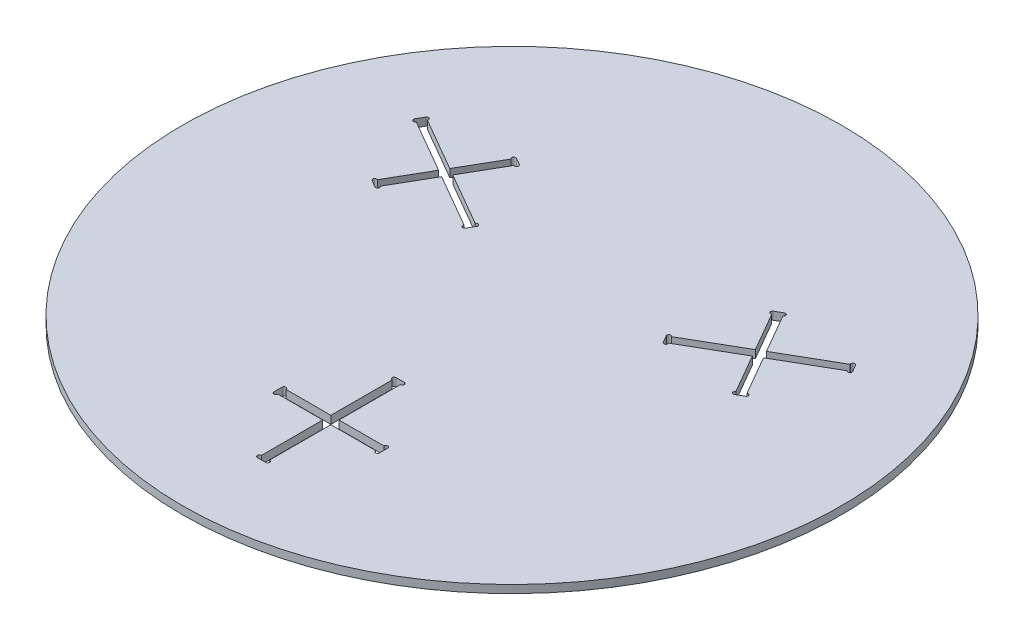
ISO-10303-21;
HEADER;
FILE_DESCRIPTION(('STEP AP214'),'2;1');
FILE_NAME('part.step','',(''),(''),'','','');
FILE_SCHEMA(('AUTOMOTIVE_DESIGN { 1 0 10303 214 1 1 1 1 }'));
ENDSEC;
DATA;
#1=APPLICATION_CONTEXT('core data for automotive mechanical design processes');
#2=APPLICATION_PROTOCOL_DEFINITION('international standard','automotive_design',2000,#1);
#3=PRODUCT_CONTEXT('',#1,'mechanical');
#4=PRODUCT('Part','Part','',(#3));
#5=PRODUCT_RELATED_PRODUCT_CATEGORY('part','',(#4));
#6=PRODUCT_DEFINITION_FORMATION('','',#4);
#7=PRODUCT_DEFINITION_CONTEXT('part definition',#1,'design');
#8=PRODUCT_DEFINITION('design','',#6,#7);
#9=PRODUCT_DEFINITION_SHAPE('','',#8);
#10=(LENGTH_UNIT() NAMED_UNIT(*) SI_UNIT(.MILLI.,.METRE.));
#11=(NAMED_UNIT(*) PLANE_ANGLE_UNIT() SI_UNIT($,.RADIAN.));
#12=(NAMED_UNIT(*) SI_UNIT($,.STERADIAN.) SOLID_ANGLE_UNIT());
#13=UNCERTAINTY_MEASURE_WITH_UNIT(LENGTH_MEASURE(1.E-05),#10,'distance_accuracy_value','');
#14=(GEOMETRIC_REPRESENTATION_CONTEXT(3) GLOBAL_UNCERTAINTY_ASSIGNED_CONTEXT((#13)) GLOBAL_UNIT_ASSIGNED_CONTEXT((#10,
#11,#12)) REPRESENTATION_CONTEXT('',''));
#15=CARTESIAN_POINT('',(0.,0.,0.));
#16=DIRECTION('',(0.,0.,1.));
#17=DIRECTION('',(1.,0.,0.));
#18=AXIS2_PLACEMENT_3D('',#15,#16,#17);
#19=CARTESIAN_POINT('',(0.,6.,0.));
#20=DIRECTION('',(0.,-1.,0.));
#21=DIRECTION('',(0.,0.,-1.));
#22=AXIS2_PLACEMENT_3D('',#19,#20,#21);
#23=CYLINDRICAL_SURFACE('',#22,500.);
#24=CARTESIAN_POINT('',(0.,6.,0.));
#25=DIRECTION('',(0.,1.,0.));
#26=DIRECTION('',(0.,0.,1.));
#27=AXIS2_PLACEMENT_3D('',#24,#25,#26);
#28=CIRCLE('',#27,500.);
#29=CARTESIAN_POINT('',(0.,6.,500.));
#30=VERTEX_POINT('',#29);
#31=EDGE_CURVE('E11',#30,#30,#28,.T.);
#32=ORIENTED_EDGE('',*,*,#31,.F.);
#33=EDGE_LOOP('',(#32));
#34=FACE_BOUND('',#33,.T.);
#35=CARTESIAN_POINT('',(0.,-6.,0.));
#36=DIRECTION('',(0.,1.,0.));
#37=DIRECTION('',(0.,0.,1.));
#38=AXIS2_PLACEMENT_3D('',#35,#36,#37);
#39=CIRCLE('',#38,500.);
#40=CARTESIAN_POINT('',(0.,-6.,500.));
#41=VERTEX_POINT('',#40);
#42=EDGE_CURVE('E38',#41,#41,#39,.T.);
#43=ORIENTED_EDGE('',*,*,#42,.T.);
#44=EDGE_LOOP('',(#43));
#45=FACE_BOUND('',#44,.T.);
#46=ADVANCED_FACE('F35',(#34,#45),#23,.T.);
#47=CARTESIAN_POINT('',(0.,6.,0.));
#48=DIRECTION('',(0.,1.,0.));
#49=DIRECTION('',(0.,0.,1.));
#50=AXIS2_PLACEMENT_3D('',#47,#48,#49);
#51=PLANE('',#50);
#52=CARTESIAN_POINT('',(-204.753138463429,6.,-207.357161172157));
#53=DIRECTION('',(0.,1.,0.));
#54=DIRECTION('',(0.,0.,1.));
#55=AXIS2_PLACEMENT_3D('',#52,#53,#54);
#56=CIRCLE('',#55,2.99999999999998);
#57=CARTESIAN_POINT('',(-203.253138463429,6.,-209.95523738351));
#58=VERTEX_POINT('',#57);
#59=CARTESIAN_POINT('',(-206.253138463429,6.,-204.759084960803));
#60=VERTEX_POINT('',#59);
#61=EDGE_CURVE('E49',#58,#60,#56,.T.);
#62=ORIENTED_EDGE('',*,*,#61,.F.);
#63=DIRECTION('',(0.866025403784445,0.,0.499999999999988));
#64=VECTOR('',#63,1.);
#65=CARTESIAN_POINT('',(40.0999999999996,6.,-69.4552373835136));
#66=LINE('',#65,#64);
#67=CARTESIAN_POINT('',(-192.514423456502,6.,-203.75523738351));
#68=VERTEX_POINT('',#67);
#69=EDGE_CURVE('E428',#58,#68,#66,.T.);
#70=ORIENTED_EDGE('',*,*,#69,.T.);
#71=CARTESIAN_POINT('',(-194.014423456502,6.,-201.157161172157));
#72=DIRECTION('',(0.,1.,0.));
#73=DIRECTION('',(0.,0.,1.));
#74=AXIS2_PLACEMENT_3D('',#71,#72,#73);
#75=CIRCLE('',#74,3.00000000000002);
#76=CARTESIAN_POINT('',(-195.514423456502,6.,-198.559084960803));
#77=VERTEX_POINT('',#76);
#78=EDGE_CURVE('E431',#77,#68,#75,.T.);
#79=ORIENTED_EDGE('',*,*,#78,.F.);
#80=DIRECTION('',(-0.499999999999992,0.,0.866025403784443));
#81=VECTOR('',#80,1.);
#82=CARTESIAN_POINT('',(-232.614423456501,6.,-134.299999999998));
#83=LINE('',#82,#81);
#84=CARTESIAN_POINT('',(-229.514423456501,6.,-139.669357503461));
#85=VERTEX_POINT('',#84);
#86=EDGE_CURVE('E522',#77,#85,#83,.T.);
#87=ORIENTED_EDGE('',*,*,#86,.T.);
#88=DIRECTION('',(0.866025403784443,0.,0.499999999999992));
#89=VECTOR('',#88,1.);
#90=CARTESIAN_POINT('',(3.09999999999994,6.,-5.36935750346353));
#91=LINE('',#90,#89);
#92=CARTESIAN_POINT('',(-148.974060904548,6.,-93.1693575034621));
#93=VERTEX_POINT('',#92);
#94=EDGE_CURVE('E519',#85,#93,#91,.T.);
#95=ORIENTED_EDGE('',*,*,#94,.T.);
#96=CARTESIAN_POINT('',(-146.375984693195,6.,-91.6693575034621));
#97=DIRECTION('',(0.,1.,0.));
#98=DIRECTION('',(0.,0.,1.));
#99=AXIS2_PLACEMENT_3D('',#96,#97,#98);
#100=CIRCLE('',#99,3.);
#101=CARTESIAN_POINT('',(-143.777908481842,6.,-90.1693575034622));
#102=VERTEX_POINT('',#101);
#103=EDGE_CURVE('E516',#102,#93,#100,.T.);
#104=ORIENTED_EDGE('',*,*,#103,.F.);
#105=DIRECTION('',(-0.499999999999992,0.,0.866025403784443));
#106=VECTOR('',#105,1.);
#107=CARTESIAN_POINT('',(-146.877908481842,6.,-84.7999999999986));
#108=LINE('',#107,#106);
#109=CARTESIAN_POINT('',(-149.977908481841,6.,-79.4306424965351));
#110=VERTEX_POINT('',#109);
#111=EDGE_CURVE('E513',#102,#110,#108,.T.);
#112=ORIENTED_EDGE('',*,*,#111,.T.);
#113=CARTESIAN_POINT('',(-152.575984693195,6.,-80.930642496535));
#114=DIRECTION('',(0.,1.,0.));
#115=DIRECTION('',(0.,0.,1.));
#116=AXIS2_PLACEMENT_3D('',#113,#114,#115);
#117=CIRCLE('',#116,3.);
#118=CARTESIAN_POINT('',(-155.174060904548,6.,-82.430642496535));
#119=VERTEX_POINT('',#118);
#120=EDGE_CURVE('E510',#119,#110,#117,.T.);
#121=ORIENTED_EDGE('',*,*,#120,.F.);
#122=DIRECTION('',(-0.866025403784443,0.,-0.499999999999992));
#123=VECTOR('',#122,1.);
#124=CARTESIAN_POINT('',(-3.09999999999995,6.,5.36935750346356));
#125=LINE('',#124,#123);
#126=CARTESIAN_POINT('',(-235.714423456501,6.,-128.930642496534));
#127=VERTEX_POINT('',#126);
#128=EDGE_CURVE('E507',#119,#127,#125,.T.);
#129=ORIENTED_EDGE('',*,*,#128,.T.);
#130=DIRECTION('',(-0.499999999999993,0.,0.866025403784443));
#131=VECTOR('',#130,1.);
#132=CARTESIAN_POINT('',(-232.614423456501,6.,-134.299999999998));
#133=LINE('',#132,#131);
#134=CARTESIAN_POINT('',(-269.714423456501,6.,-70.0409150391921));
#135=VERTEX_POINT('',#134);
#136=EDGE_CURVE('E504',#127,#135,#133,.T.);
#137=ORIENTED_EDGE('',*,*,#136,.T.);
#138=CARTESIAN_POINT('',(-271.214423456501,6.,-67.4428388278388));
#139=DIRECTION('',(0.,1.,0.));
#140=DIRECTION('',(0.,0.,1.));
#141=AXIS2_PLACEMENT_3D('',#138,#139,#140);
#142=CIRCLE('',#141,3.);
#143=CARTESIAN_POINT('',(-272.714423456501,6.,-64.8447626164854));
#144=VERTEX_POINT('',#143);
#145=EDGE_CURVE('E501',#144,#135,#142,.T.);
#146=ORIENTED_EDGE('',*,*,#145,.F.);
#147=DIRECTION('',(-0.866025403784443,0.,-0.499999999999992));
#148=VECTOR('',#147,1.);
#149=CARTESIAN_POINT('',(-40.0999999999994,6.,69.4552373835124));
#150=LINE('',#149,#148);
#151=CARTESIAN_POINT('',(-283.453138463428,6.,-71.0447626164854));
#152=VERTEX_POINT('',#151);
#153=EDGE_CURVE('E498',#144,#152,#150,.T.);
#154=ORIENTED_EDGE('',*,*,#153,.T.);
#155=CARTESIAN_POINT('',(-281.953138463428,6.,-73.6428388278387));
#156=DIRECTION('',(0.,1.,0.));
#157=DIRECTION('',(0.,0.,1.));
#158=AXIS2_PLACEMENT_3D('',#155,#156,#157);
#159=CIRCLE('',#158,3.00000000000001);
#160=CARTESIAN_POINT('',(-280.453138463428,6.,-76.240915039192));
#161=VERTEX_POINT('',#160);
#162=EDGE_CURVE('E495',#161,#152,#159,.T.);
#163=ORIENTED_EDGE('',*,*,#162,.F.);
#164=DIRECTION('',(0.499999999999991,0.,-0.866025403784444));
#165=VECTOR('',#164,1.);
#166=CARTESIAN_POINT('',(-243.353138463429,6.,-140.499999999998));
#167=LINE('',#166,#165);
#168=CARTESIAN_POINT('',(-246.453138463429,6.,-135.130642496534));
#169=VERTEX_POINT('',#168);
#170=EDGE_CURVE('E492',#161,#169,#167,.T.);
#171=ORIENTED_EDGE('',*,*,#170,.T.);
#172=DIRECTION('',(-0.866025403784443,0.,-0.499999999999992));
#173=VECTOR('',#172,1.);
#174=CARTESIAN_POINT('',(-3.09999999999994,6.,5.36935750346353));
#175=LINE('',#174,#173);
#176=CARTESIAN_POINT('',(-326.993501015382,6.,-181.630642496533));
#177=VERTEX_POINT('',#176);
#178=EDGE_CURVE('E489',#169,#177,#175,.T.);
#179=ORIENTED_EDGE('',*,*,#178,.T.);
#180=CARTESIAN_POINT('',(-329.591577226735,6.,-183.130642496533));
#181=DIRECTION('',(0.,1.,0.));
#182=DIRECTION('',(0.,0.,1.));
#183=AXIS2_PLACEMENT_3D('',#180,#181,#182);
#184=CIRCLE('',#183,3.);
#185=CARTESIAN_POINT('',(-332.189653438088,6.,-184.630642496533));
#186=VERTEX_POINT('',#185);
#187=EDGE_CURVE('E486',#186,#177,#184,.T.);
#188=ORIENTED_EDGE('',*,*,#187,.F.);
#189=DIRECTION('',(0.499999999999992,0.,-0.866025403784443));
#190=VECTOR('',#189,1.);
#191=CARTESIAN_POINT('',(-329.089653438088,6.,-189.999999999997));
#192=LINE('',#191,#190);
#193=CARTESIAN_POINT('',(-325.989653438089,6.,-195.36935750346));
#194=VERTEX_POINT('',#193);
#195=EDGE_CURVE('E483',#186,#194,#192,.T.);
#196=ORIENTED_EDGE('',*,*,#195,.T.);
#197=CARTESIAN_POINT('',(-323.391577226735,6.,-193.869357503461));
#198=DIRECTION('',(0.,1.,0.));
#199=DIRECTION('',(0.,0.,1.));
#200=AXIS2_PLACEMENT_3D('',#197,#198,#199);
#201=CIRCLE('',#200,3.);
#202=CARTESIAN_POINT('',(-320.793501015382,6.,-192.369357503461));
#203=VERTEX_POINT('',#202);
#204=EDGE_CURVE('E480',#203,#194,#201,.T.);
#205=ORIENTED_EDGE('',*,*,#204,.F.);
#206=DIRECTION('',(0.866025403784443,0.,0.499999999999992));
#207=VECTOR('',#206,1.);
#208=CARTESIAN_POINT('',(3.09999999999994,6.,-5.36935750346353));
#209=LINE('',#208,#207);
#210=CARTESIAN_POINT('',(-240.253138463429,6.,-145.869357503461));
#211=VERTEX_POINT('',#210);
#212=EDGE_CURVE('E477',#203,#211,#209,.T.);
#213=ORIENTED_EDGE('',*,*,#212,.T.);
#214=DIRECTION('',(0.499999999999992,0.,-0.866025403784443));
#215=VECTOR('',#214,1.);
#216=CARTESIAN_POINT('',(-243.353138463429,6.,-140.499999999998));
#217=LINE('',#216,#215);
#218=EDGE_CURVE('E475',#211,#60,#217,.T.);
#219=ORIENTED_EDGE('',*,*,#218,.T.);
#220=EDGE_LOOP('',(#62,#70,#79,#87,#95,#104,#112,#121,#129,#137,#146,#154,#163,#171,#179,#188,
#196,#205,#213,#219));
#221=FACE_BOUND('',#220,.T.);
#222=CARTESIAN_POINT('',(281.953138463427,6.,-73.6428388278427));
#223=DIRECTION('',(0.,1.,0.));
#224=DIRECTION('',(0.,0.,1.));
#225=AXIS2_PLACEMENT_3D('',#222,#223,#224);
#226=CIRCLE('',#225,2.99999999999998);
#227=CARTESIAN_POINT('',(283.453138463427,6.,-71.0447626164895));
#228=VERTEX_POINT('',#227);
#229=CARTESIAN_POINT('',(280.453138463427,6.,-76.2409150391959));
#230=VERTEX_POINT('',#229);
#231=EDGE_CURVE('E529',#228,#230,#226,.T.);
#232=ORIENTED_EDGE('',*,*,#231,.F.);
#233=DIRECTION('',(-0.866025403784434,0.,0.500000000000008));
#234=VECTOR('',#233,1.);
#235=CARTESIAN_POINT('',(40.1000000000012,6.,69.4552373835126));
#236=LINE('',#235,#234);
#237=CARTESIAN_POINT('',(272.7144234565,6.,-64.8447626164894));
#238=VERTEX_POINT('',#237);
#239=EDGE_CURVE('E569',#228,#238,#236,.T.);
#240=ORIENTED_EDGE('',*,*,#239,.T.);
#241=CARTESIAN_POINT('',(271.2144234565,6.,-67.4428388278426));
#242=DIRECTION('',(0.,1.,0.));
#243=DIRECTION('',(0.,0.,1.));
#244=AXIS2_PLACEMENT_3D('',#241,#242,#243);
#245=CIRCLE('',#244,3.00000000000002);
#246=CARTESIAN_POINT('',(269.7144234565,6.,-70.040915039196));
#247=VERTEX_POINT('',#246);
#248=EDGE_CURVE('E668',#247,#238,#245,.T.);
#249=ORIENTED_EDGE('',*,*,#248,.F.);
#250=DIRECTION('',(-0.500000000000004,0.,-0.866025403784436));
#251=VECTOR('',#250,1.);
#252=CARTESIAN_POINT('',(232.6144234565,6.,-134.300000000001));
#253=LINE('',#252,#251);
#254=CARTESIAN_POINT('',(235.7144234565,6.,-128.930642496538));
#255=VERTEX_POINT('',#254);
#256=EDGE_CURVE('E665',#247,#255,#253,.T.);
#257=ORIENTED_EDGE('',*,*,#256,.T.);
#258=DIRECTION('',(-0.866025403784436,0.,0.500000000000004));
#259=VECTOR('',#258,1.);
#260=CARTESIAN_POINT('',(3.10000000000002,6.,5.3693575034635));
#261=LINE('',#260,#259);
#262=CARTESIAN_POINT('',(155.174060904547,6.,-82.4306424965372));
#263=VERTEX_POINT('',#262);
#264=EDGE_CURVE('E662',#255,#263,#261,.T.);
#265=ORIENTED_EDGE('',*,*,#264,.T.);
#266=CARTESIAN_POINT('',(152.575984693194,6.,-80.9306424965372));
#267=DIRECTION('',(0.,1.,0.));
#268=DIRECTION('',(0.,0.,1.));
#269=AXIS2_PLACEMENT_3D('',#266,#267,#268);
#270=CIRCLE('',#269,3.);
#271=CARTESIAN_POINT('',(149.97790848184,6.,-79.4306424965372));
#272=VERTEX_POINT('',#271);
#273=EDGE_CURVE('E659',#272,#263,#270,.T.);
#274=ORIENTED_EDGE('',*,*,#273,.F.);
#275=DIRECTION('',(-0.500000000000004,0.,-0.866025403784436));
#276=VECTOR('',#275,1.);
#277=CARTESIAN_POINT('',(146.87790848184,6.,-84.8000000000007));
#278=LINE('',#277,#276);
#279=CARTESIAN_POINT('',(143.77790848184,6.,-90.1693575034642));
#280=VERTEX_POINT('',#279);
#281=EDGE_CURVE('E656',#272,#280,#278,.T.);
#282=ORIENTED_EDGE('',*,*,#281,.T.);
#283=CARTESIAN_POINT('',(146.375984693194,6.,-91.6693575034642));
#284=DIRECTION('',(0.,1.,0.));
#285=DIRECTION('',(0.,0.,1.));
#286=AXIS2_PLACEMENT_3D('',#283,#284,#285);
#287=CIRCLE('',#286,3.);
#288=CARTESIAN_POINT('',(148.974060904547,6.,-93.1693575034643));
#289=VERTEX_POINT('',#288);
#290=EDGE_CURVE('E653',#289,#280,#287,.T.);
#291=ORIENTED_EDGE('',*,*,#290,.F.);
#292=DIRECTION('',(0.866025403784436,0.,-0.500000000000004));
#293=VECTOR('',#292,1.);
#294=CARTESIAN_POINT('',(-3.10000000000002,6.,-5.3693575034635));
#295=LINE('',#294,#293);
#296=CARTESIAN_POINT('',(229.5144234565,6.,-139.669357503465));
#297=VERTEX_POINT('',#296);
#298=EDGE_CURVE('E650',#289,#297,#295,.T.);
#299=ORIENTED_EDGE('',*,*,#298,.T.);
#300=DIRECTION('',(-0.500000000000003,0.,-0.866025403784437));
#301=VECTOR('',#300,1.);
#302=CARTESIAN_POINT('',(232.6144234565,6.,-134.300000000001));
#303=LINE('',#302,#301);
#304=CARTESIAN_POINT('',(195.514423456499,6.,-198.559084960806));
#305=VERTEX_POINT('',#304);
#306=EDGE_CURVE('E647',#297,#305,#303,.T.);
#307=ORIENTED_EDGE('',*,*,#306,.T.);
#308=CARTESIAN_POINT('',(194.014423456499,6.,-201.15716117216));
#309=DIRECTION('',(0.,1.,0.));
#310=DIRECTION('',(0.,0.,1.));
#311=AXIS2_PLACEMENT_3D('',#308,#309,#310);
#312=CIRCLE('',#311,3.);
#313=CARTESIAN_POINT('',(192.514423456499,6.,-203.755237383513));
#314=VERTEX_POINT('',#313);
#315=EDGE_CURVE('E644',#314,#305,#312,.T.);
#316=ORIENTED_EDGE('',*,*,#315,.F.);
#317=DIRECTION('',(0.866025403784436,0.,-0.500000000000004));
#318=VECTOR('',#317,1.);
#319=CARTESIAN_POINT('',(-40.1000000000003,6.,-69.4552373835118));
#320=LINE('',#319,#318);
#321=CARTESIAN_POINT('',(203.253138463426,6.,-209.955237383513));
#322=VERTEX_POINT('',#321);
#323=EDGE_CURVE('E641',#314,#322,#320,.T.);
#324=ORIENTED_EDGE('',*,*,#323,.T.);
#325=CARTESIAN_POINT('',(204.753138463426,6.,-207.35716117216));
#326=DIRECTION('',(0.,1.,0.));
#327=DIRECTION('',(0.,0.,1.));
#328=AXIS2_PLACEMENT_3D('',#325,#326,#327);
#329=CIRCLE('',#328,3.00000000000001);
#330=CARTESIAN_POINT('',(206.253138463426,6.,-204.759084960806));
#331=VERTEX_POINT('',#330);
#332=EDGE_CURVE('E638',#331,#322,#329,.T.);
#333=ORIENTED_EDGE('',*,*,#332,.F.);
#334=DIRECTION('',(0.500000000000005,0.,0.866025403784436));
#335=VECTOR('',#334,1.);
#336=CARTESIAN_POINT('',(243.353138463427,6.,-140.500000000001));
#337=LINE('',#336,#335);
#338=CARTESIAN_POINT('',(240.253138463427,6.,-145.869357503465));
#339=VERTEX_POINT('',#338);
#340=EDGE_CURVE('E635',#331,#339,#337,.T.);
#341=ORIENTED_EDGE('',*,*,#340,.T.);
#342=DIRECTION('',(0.866025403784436,0.,-0.500000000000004));
#343=VECTOR('',#342,1.);
#344=CARTESIAN_POINT('',(-3.10000000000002,6.,-5.36935750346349));
#345=LINE('',#344,#343);
#346=CARTESIAN_POINT('',(320.793501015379,6.,-192.369357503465));
#347=VERTEX_POINT('',#346);
#348=EDGE_CURVE('E632',#339,#347,#345,.T.);
#349=ORIENTED_EDGE('',*,*,#348,.T.);
#350=CARTESIAN_POINT('',(323.391577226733,6.,-193.869357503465));
#351=DIRECTION('',(0.,1.,0.));
#352=DIRECTION('',(0.,0.,1.));
#353=AXIS2_PLACEMENT_3D('',#350,#351,#352);
#354=CIRCLE('',#353,3.);
#355=CARTESIAN_POINT('',(325.989653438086,6.,-195.369357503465));
#356=VERTEX_POINT('',#355);
#357=EDGE_CURVE('E629',#356,#347,#354,.T.);
#358=ORIENTED_EDGE('',*,*,#357,.F.);
#359=DIRECTION('',(0.500000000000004,0.,0.866025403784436));
#360=VECTOR('',#359,1.);
#361=CARTESIAN_POINT('',(329.089653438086,6.,-190.000000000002));
#362=LINE('',#361,#360);
#363=CARTESIAN_POINT('',(332.189653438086,6.,-184.630642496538));
#364=VERTEX_POINT('',#363);
#365=EDGE_CURVE('E626',#356,#364,#362,.T.);
#366=ORIENTED_EDGE('',*,*,#365,.T.);
#367=CARTESIAN_POINT('',(329.591577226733,6.,-183.130642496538));
#368=DIRECTION('',(0.,1.,0.));
#369=DIRECTION('',(0.,0.,1.));
#370=AXIS2_PLACEMENT_3D('',#367,#368,#369);
#371=CIRCLE('',#370,3.);
#372=CARTESIAN_POINT('',(326.993501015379,6.,-181.630642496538));
#373=VERTEX_POINT('',#372);
#374=EDGE_CURVE('E623',#373,#364,#371,.T.);
#375=ORIENTED_EDGE('',*,*,#374,.F.);
#376=DIRECTION('',(-0.866025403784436,0.,0.500000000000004));
#377=VECTOR('',#376,1.);
#378=CARTESIAN_POINT('',(3.10000000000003,6.,5.36935750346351));
#379=LINE('',#378,#377);
#380=CARTESIAN_POINT('',(246.453138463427,6.,-135.130642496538));
#381=VERTEX_POINT('',#380);
#382=EDGE_CURVE('E620',#373,#381,#379,.T.);
#383=ORIENTED_EDGE('',*,*,#382,.T.);
#384=DIRECTION('',(0.500000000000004,0.,0.866025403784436));
#385=VECTOR('',#384,1.);
#386=CARTESIAN_POINT('',(243.353138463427,6.,-140.500000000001));
#387=LINE('',#386,#385);
#388=EDGE_CURVE('E617',#381,#230,#387,.T.);
#389=ORIENTED_EDGE('',*,*,#388,.T.);
#390=EDGE_LOOP('',(#232,#240,#249,#257,#265,#274,#282,#291,#299,#307,#316,#324,#333,#341,#349,
#358,#366,#375,#383,#389));
#391=FACE_BOUND('',#390,.T.);
#392=CARTESIAN_POINT('',(-77.2,6.,281.));
#393=DIRECTION('',(0.,1.,0.));
#394=DIRECTION('',(0.,0.,1.));
#395=AXIS2_PLACEMENT_3D('',#392,#393,#394);
#396=CIRCLE('',#395,2.99999999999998);
#397=CARTESIAN_POINT('',(-80.1999999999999,6.,281.));
#398=VERTEX_POINT('',#397);
#399=CARTESIAN_POINT('',(-74.2,6.,281.));
#400=VERTEX_POINT('',#399);
#401=EDGE_CURVE('E675',#398,#400,#396,.T.);
#402=ORIENTED_EDGE('',*,*,#401,.F.);
#403=DIRECTION('',(0.,0.,-1.));
#404=VECTOR('',#403,1.);
#405=CARTESIAN_POINT('',(-80.2000000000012,6.,3.59031800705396E-13));
#406=LINE('',#405,#404);
#407=CARTESIAN_POINT('',(-80.2,6.,268.6));
#408=VERTEX_POINT('',#407);
#409=EDGE_CURVE('E718',#398,#408,#406,.T.);
#410=ORIENTED_EDGE('',*,*,#409,.T.);
#411=CARTESIAN_POINT('',(-77.1999999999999,6.,268.6));
#412=DIRECTION('',(0.,1.,0.));
#413=DIRECTION('',(0.,0.,1.));
#414=AXIS2_PLACEMENT_3D('',#411,#412,#413);
#415=CIRCLE('',#414,3.00000000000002);
#416=CARTESIAN_POINT('',(-74.1999999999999,6.,268.6));
#417=VERTEX_POINT('',#416);
#418=EDGE_CURVE('E817',#417,#408,#415,.T.);
#419=ORIENTED_EDGE('',*,*,#418,.F.);
#420=DIRECTION('',(1.,0.,0.));
#421=VECTOR('',#420,1.);
#422=CARTESIAN_POINT('',(0.,6.,268.6));
#423=LINE('',#422,#421);
#424=CARTESIAN_POINT('',(-6.2,6.,268.6));
#425=VERTEX_POINT('',#424);
#426=EDGE_CURVE('E814',#417,#425,#423,.T.);
#427=ORIENTED_EDGE('',*,*,#426,.T.);
#428=DIRECTION('',(0.,0.,-1.));
#429=VECTOR('',#428,1.);
#430=CARTESIAN_POINT('',(-6.2,6.,0.));
#431=LINE('',#430,#429);
#432=CARTESIAN_POINT('',(-6.2,6.,175.6));
#433=VERTEX_POINT('',#432);
#434=EDGE_CURVE('E811',#425,#433,#431,.T.);
#435=ORIENTED_EDGE('',*,*,#434,.T.);
#436=CARTESIAN_POINT('',(-6.19999999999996,6.,172.6));
#437=DIRECTION('',(0.,1.,0.));
#438=DIRECTION('',(0.,0.,1.));
#439=AXIS2_PLACEMENT_3D('',#436,#437,#438);
#440=CIRCLE('',#439,3.);
#441=CARTESIAN_POINT('',(-6.19999999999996,6.,169.6));
#442=VERTEX_POINT('',#441);
#443=EDGE_CURVE('E808',#442,#433,#440,.T.);
#444=ORIENTED_EDGE('',*,*,#443,.F.);
#445=DIRECTION('',(1.,0.,0.));
#446=VECTOR('',#445,1.);
#447=CARTESIAN_POINT('',(0.,6.,169.6));
#448=LINE('',#447,#446);
#449=CARTESIAN_POINT('',(6.2,6.,169.6));
#450=VERTEX_POINT('',#449);
#451=EDGE_CURVE('E805',#442,#450,#448,.T.);
#452=ORIENTED_EDGE('',*,*,#451,.T.);
#453=CARTESIAN_POINT('',(6.2,6.,172.6));
#454=DIRECTION('',(0.,1.,0.));
#455=DIRECTION('',(0.,0.,1.));
#456=AXIS2_PLACEMENT_3D('',#453,#454,#455);
#457=CIRCLE('',#456,3.);
#458=CARTESIAN_POINT('',(6.20000000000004,6.,175.6));
#459=VERTEX_POINT('',#458);
#460=EDGE_CURVE('E802',#459,#450,#457,.T.);
#461=ORIENTED_EDGE('',*,*,#460,.F.);
#462=DIRECTION('',(0.,0.,1.));
#463=VECTOR('',#462,1.);
#464=CARTESIAN_POINT('',(6.2,6.,0.));
#465=LINE('',#464,#463);
#466=CARTESIAN_POINT('',(6.20000000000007,6.,268.6));
#467=VERTEX_POINT('',#466);
#468=EDGE_CURVE('E799',#459,#467,#465,.T.);
#469=ORIENTED_EDGE('',*,*,#468,.T.);
#470=DIRECTION('',(1.,0.,0.));
#471=VECTOR('',#470,1.);
#472=CARTESIAN_POINT('',(-2.19269047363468E-13,6.,268.6));
#473=LINE('',#472,#471);
#474=CARTESIAN_POINT('',(74.2,6.,268.6));
#475=VERTEX_POINT('',#474);
#476=EDGE_CURVE('E796',#467,#475,#473,.T.);
#477=ORIENTED_EDGE('',*,*,#476,.T.);
#478=CARTESIAN_POINT('',(77.2,6.,268.6));
#479=DIRECTION('',(0.,1.,0.));
#480=DIRECTION('',(0.,0.,1.));
#481=AXIS2_PLACEMENT_3D('',#478,#479,#480);
#482=CIRCLE('',#481,3.);
#483=CARTESIAN_POINT('',(80.2,6.,268.6));
#484=VERTEX_POINT('',#483);
#485=EDGE_CURVE('E793',#484,#475,#482,.T.);
#486=ORIENTED_EDGE('',*,*,#485,.F.);
#487=DIRECTION('',(0.,0.,1.));
#488=VECTOR('',#487,1.);
#489=CARTESIAN_POINT('',(80.2,6.,0.));
#490=LINE('',#489,#488);
#491=CARTESIAN_POINT('',(80.2,6.,281.));
#492=VERTEX_POINT('',#491);
#493=EDGE_CURVE('E790',#484,#492,#490,.T.);
#494=ORIENTED_EDGE('',*,*,#493,.T.);
#495=CARTESIAN_POINT('',(77.2,6.,281.));
#496=DIRECTION('',(0.,1.,0.));
#497=DIRECTION('',(0.,0.,1.));
#498=AXIS2_PLACEMENT_3D('',#495,#496,#497);
#499=CIRCLE('',#498,3.00000000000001);
#500=CARTESIAN_POINT('',(74.2,6.,281.));
#501=VERTEX_POINT('',#500);
#502=EDGE_CURVE('E787',#501,#492,#499,.T.);
#503=ORIENTED_EDGE('',*,*,#502,.F.);
#504=DIRECTION('',(-1.,0.,0.));
#505=VECTOR('',#504,1.);
#506=CARTESIAN_POINT('',(2.2939166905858E-13,6.,281.));
#507=LINE('',#506,#505);
#508=CARTESIAN_POINT('',(6.20000000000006,6.,281.));
#509=VERTEX_POINT('',#508);
#510=EDGE_CURVE('E784',#501,#509,#507,.T.);
#511=ORIENTED_EDGE('',*,*,#510,.T.);
#512=DIRECTION('',(0.,0.,1.));
#513=VECTOR('',#512,1.);
#514=CARTESIAN_POINT('',(6.19999999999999,6.,0.));
#515=LINE('',#514,#513);
#516=CARTESIAN_POINT('',(6.20000000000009,6.,374.));
#517=VERTEX_POINT('',#516);
#518=EDGE_CURVE('E781',#509,#517,#515,.T.);
#519=ORIENTED_EDGE('',*,*,#518,.T.);
#520=CARTESIAN_POINT('',(6.20000000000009,6.,377.));
#521=DIRECTION('',(0.,1.,0.));
#522=DIRECTION('',(0.,0.,1.));
#523=AXIS2_PLACEMENT_3D('',#520,#521,#522);
#524=CIRCLE('',#523,3.);
#525=CARTESIAN_POINT('',(6.20000000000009,6.,380.));
#526=VERTEX_POINT('',#525);
#527=EDGE_CURVE('E778',#526,#517,#524,.T.);
#528=ORIENTED_EDGE('',*,*,#527,.F.);
#529=DIRECTION('',(-1.,0.,0.));
#530=VECTOR('',#529,1.);
#531=CARTESIAN_POINT('',(0.,6.,380.));
#532=LINE('',#531,#530);
#533=CARTESIAN_POINT('',(-6.2,6.,380.));
#534=VERTEX_POINT('',#533);
#535=EDGE_CURVE('E775',#526,#534,#532,.T.);
#536=ORIENTED_EDGE('',*,*,#535,.T.);
#537=CARTESIAN_POINT('',(-6.2,6.,377.));
#538=DIRECTION('',(0.,1.,0.));
#539=DIRECTION('',(0.,0.,1.));
#540=AXIS2_PLACEMENT_3D('',#537,#538,#539);
#541=CIRCLE('',#540,3.);
#542=CARTESIAN_POINT('',(-6.2,6.,374.));
#543=VERTEX_POINT('',#542);
#544=EDGE_CURVE('E772',#543,#534,#541,.T.);
#545=ORIENTED_EDGE('',*,*,#544,.F.);
#546=DIRECTION('',(0.,0.,-1.));
#547=VECTOR('',#546,1.);
#548=CARTESIAN_POINT('',(-6.19999999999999,6.,0.));
#549=LINE('',#548,#547);
#550=CARTESIAN_POINT('',(-6.2,6.,281.));
#551=VERTEX_POINT('',#550);
#552=EDGE_CURVE('E769',#543,#551,#549,.T.);
#553=ORIENTED_EDGE('',*,*,#552,.T.);
#554=DIRECTION('',(-1.,0.,0.));
#555=VECTOR('',#554,1.);
#556=CARTESIAN_POINT('',(0.,6.,281.));
#557=LINE('',#556,#555);
#558=EDGE_CURVE('E766',#551,#400,#557,.T.);
#559=ORIENTED_EDGE('',*,*,#558,.T.);
#560=EDGE_LOOP('',(#402,#410,#419,#427,#435,#444,#452,#461,#469,#477,#486,#494,#503,#511,#519,
#528,#536,#545,#553,#559));
#561=FACE_BOUND('',#560,.T.);
#562=ORIENTED_EDGE('',*,*,#31,.T.);
#563=EDGE_LOOP('',(#562));
#564=FACE_BOUND('',#563,.T.);
#565=ADVANCED_FACE('F870',(#221,#391,#561,#564),#51,.T.);
#566=CARTESIAN_POINT('',(0.,-6.,0.));
#567=DIRECTION('',(0.,1.,0.));
#568=DIRECTION('',(0.,0.,1.));
#569=AXIS2_PLACEMENT_3D('',#566,#567,#568);
#570=PLANE('',#569);
#571=DIRECTION('',(0.866025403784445,0.,0.499999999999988));
#572=VECTOR('',#571,1.);
#573=CARTESIAN_POINT('',(40.0999999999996,-6.,-69.4552373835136));
#574=LINE('',#573,#572);
#575=CARTESIAN_POINT('',(-203.253138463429,-6.,-209.95523738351));
#576=VERTEX_POINT('',#575);
#577=CARTESIAN_POINT('',(-192.514423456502,-6.,-203.75523738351));
#578=VERTEX_POINT('',#577);
#579=EDGE_CURVE('E423',#576,#578,#574,.T.);
#580=ORIENTED_EDGE('',*,*,#579,.F.);
#581=CARTESIAN_POINT('',(-204.753138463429,-6.,-207.357161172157));
#582=DIRECTION('',(0.,1.,0.));
#583=DIRECTION('',(0.,0.,1.));
#584=AXIS2_PLACEMENT_3D('',#581,#582,#583);
#585=CIRCLE('',#584,2.99999999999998);
#586=CARTESIAN_POINT('',(-206.253138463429,-6.,-204.759084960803));
#587=VERTEX_POINT('',#586);
#588=EDGE_CURVE('E418',#576,#587,#585,.T.);
#589=ORIENTED_EDGE('',*,*,#588,.T.);
#590=DIRECTION('',(0.499999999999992,0.,-0.866025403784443));
#591=VECTOR('',#590,1.);
#592=CARTESIAN_POINT('',(-243.353138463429,-6.,-140.499999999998));
#593=LINE('',#592,#591);
#594=CARTESIAN_POINT('',(-240.253138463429,-6.,-145.869357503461));
#595=VERTEX_POINT('',#594);
#596=EDGE_CURVE('E410',#595,#587,#593,.T.);
#597=ORIENTED_EDGE('',*,*,#596,.F.);
#598=DIRECTION('',(0.866025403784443,0.,0.499999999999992));
#599=VECTOR('',#598,1.);
#600=CARTESIAN_POINT('',(3.09999999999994,-6.,-5.36935750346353));
#601=LINE('',#600,#599);
#602=CARTESIAN_POINT('',(-320.793501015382,-6.,-192.369357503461));
#603=VERTEX_POINT('',#602);
#604=EDGE_CURVE('E417',#603,#595,#601,.T.);
#605=ORIENTED_EDGE('',*,*,#604,.F.);
#606=CARTESIAN_POINT('',(-323.391577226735,-6.,-193.869357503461));
#607=DIRECTION('',(0.,1.,0.));
#608=DIRECTION('',(0.,0.,1.));
#609=AXIS2_PLACEMENT_3D('',#606,#607,#608);
#610=CIRCLE('',#609,3.);
#611=CARTESIAN_POINT('',(-325.989653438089,-6.,-195.36935750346));
#612=VERTEX_POINT('',#611);
#613=EDGE_CURVE('E435',#603,#612,#610,.T.);
#614=ORIENTED_EDGE('',*,*,#613,.T.);
#615=DIRECTION('',(0.499999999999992,0.,-0.866025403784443));
#616=VECTOR('',#615,1.);
#617=CARTESIAN_POINT('',(-329.089653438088,-6.,-189.999999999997));
#618=LINE('',#617,#616);
#619=CARTESIAN_POINT('',(-332.189653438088,-6.,-184.630642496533));
#620=VERTEX_POINT('',#619);
#621=EDGE_CURVE('E438',#620,#612,#618,.T.);
#622=ORIENTED_EDGE('',*,*,#621,.F.);
#623=CARTESIAN_POINT('',(-329.591577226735,-6.,-183.130642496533));
#624=DIRECTION('',(0.,1.,0.));
#625=DIRECTION('',(0.,0.,1.));
#626=AXIS2_PLACEMENT_3D('',#623,#624,#625);
#627=CIRCLE('',#626,3.);
#628=CARTESIAN_POINT('',(-326.993501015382,-6.,-181.630642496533));
#629=VERTEX_POINT('',#628);
#630=EDGE_CURVE('E440',#620,#629,#627,.T.);
#631=ORIENTED_EDGE('',*,*,#630,.T.);
#632=DIRECTION('',(-0.866025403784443,0.,-0.499999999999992));
#633=VECTOR('',#632,1.);
#634=CARTESIAN_POINT('',(-3.09999999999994,-6.,5.36935750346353));
#635=LINE('',#634,#633);
#636=CARTESIAN_POINT('',(-246.453138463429,-6.,-135.130642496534));
#637=VERTEX_POINT('',#636);
#638=EDGE_CURVE('E443',#637,#629,#635,.T.);
#639=ORIENTED_EDGE('',*,*,#638,.F.);
#640=DIRECTION('',(0.499999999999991,0.,-0.866025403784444));
#641=VECTOR('',#640,1.);
#642=CARTESIAN_POINT('',(-243.353138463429,-6.,-140.499999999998));
#643=LINE('',#642,#641);
#644=CARTESIAN_POINT('',(-280.453138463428,-6.,-76.240915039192));
#645=VERTEX_POINT('',#644);
#646=EDGE_CURVE('E445',#645,#637,#643,.T.);
#647=ORIENTED_EDGE('',*,*,#646,.F.);
#648=CARTESIAN_POINT('',(-281.953138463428,-6.,-73.6428388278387));
#649=DIRECTION('',(0.,1.,0.));
#650=DIRECTION('',(0.,0.,1.));
#651=AXIS2_PLACEMENT_3D('',#648,#649,#650);
#652=CIRCLE('',#651,3.00000000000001);
#653=CARTESIAN_POINT('',(-283.453138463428,-6.,-71.0447626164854));
#654=VERTEX_POINT('',#653);
#655=EDGE_CURVE('E447',#645,#654,#652,.T.);
#656=ORIENTED_EDGE('',*,*,#655,.T.);
#657=DIRECTION('',(-0.866025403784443,0.,-0.499999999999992));
#658=VECTOR('',#657,1.);
#659=CARTESIAN_POINT('',(-40.0999999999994,-6.,69.4552373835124));
#660=LINE('',#659,#658);
#661=CARTESIAN_POINT('',(-272.714423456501,-6.,-64.8447626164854));
#662=VERTEX_POINT('',#661);
#663=EDGE_CURVE('E450',#662,#654,#660,.T.);
#664=ORIENTED_EDGE('',*,*,#663,.F.);
#665=CARTESIAN_POINT('',(-271.214423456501,-6.,-67.4428388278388));
#666=DIRECTION('',(0.,1.,0.));
#667=DIRECTION('',(0.,0.,1.));
#668=AXIS2_PLACEMENT_3D('',#665,#666,#667);
#669=CIRCLE('',#668,3.);
#670=CARTESIAN_POINT('',(-269.714423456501,-6.,-70.0409150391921));
#671=VERTEX_POINT('',#670);
#672=EDGE_CURVE('E452',#662,#671,#669,.T.);
#673=ORIENTED_EDGE('',*,*,#672,.T.);
#674=DIRECTION('',(-0.499999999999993,0.,0.866025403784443));
#675=VECTOR('',#674,1.);
#676=CARTESIAN_POINT('',(-232.614423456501,-6.,-134.299999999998));
#677=LINE('',#676,#675);
#678=CARTESIAN_POINT('',(-235.714423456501,-6.,-128.930642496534));
#679=VERTEX_POINT('',#678);
#680=EDGE_CURVE('E455',#679,#671,#677,.T.);
#681=ORIENTED_EDGE('',*,*,#680,.F.);
#682=DIRECTION('',(-0.866025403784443,0.,-0.499999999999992));
#683=VECTOR('',#682,1.);
#684=CARTESIAN_POINT('',(-3.09999999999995,-6.,5.36935750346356));
#685=LINE('',#684,#683);
#686=CARTESIAN_POINT('',(-155.174060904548,-6.,-82.430642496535));
#687=VERTEX_POINT('',#686);
#688=EDGE_CURVE('E457',#687,#679,#685,.T.);
#689=ORIENTED_EDGE('',*,*,#688,.F.);
#690=CARTESIAN_POINT('',(-152.575984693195,-6.,-80.930642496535));
#691=DIRECTION('',(0.,1.,0.));
#692=DIRECTION('',(0.,0.,1.));
#693=AXIS2_PLACEMENT_3D('',#690,#691,#692);
#694=CIRCLE('',#693,3.);
#695=CARTESIAN_POINT('',(-149.977908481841,-6.,-79.4306424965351));
#696=VERTEX_POINT('',#695);
#697=EDGE_CURVE('E459',#687,#696,#694,.T.);
#698=ORIENTED_EDGE('',*,*,#697,.T.);
#699=DIRECTION('',(-0.499999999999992,0.,0.866025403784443));
#700=VECTOR('',#699,1.);
#701=CARTESIAN_POINT('',(-146.877908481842,-6.,-84.7999999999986));
#702=LINE('',#701,#700);
#703=CARTESIAN_POINT('',(-143.777908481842,-6.,-90.1693575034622));
#704=VERTEX_POINT('',#703);
#705=EDGE_CURVE('E462',#704,#696,#702,.T.);
#706=ORIENTED_EDGE('',*,*,#705,.F.);
#707=CARTESIAN_POINT('',(-146.375984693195,-6.,-91.6693575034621));
#708=DIRECTION('',(0.,1.,0.));
#709=DIRECTION('',(0.,0.,1.));
#710=AXIS2_PLACEMENT_3D('',#707,#708,#709);
#711=CIRCLE('',#710,3.);
#712=CARTESIAN_POINT('',(-148.974060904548,-6.,-93.1693575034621));
#713=VERTEX_POINT('',#712);
#714=EDGE_CURVE('E464',#704,#713,#711,.T.);
#715=ORIENTED_EDGE('',*,*,#714,.T.);
#716=DIRECTION('',(0.866025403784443,0.,0.499999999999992));
#717=VECTOR('',#716,1.);
#718=CARTESIAN_POINT('',(3.09999999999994,-6.,-5.36935750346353));
#719=LINE('',#718,#717);
#720=CARTESIAN_POINT('',(-229.514423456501,-6.,-139.669357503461));
#721=VERTEX_POINT('',#720);
#722=EDGE_CURVE('E467',#721,#713,#719,.T.);
#723=ORIENTED_EDGE('',*,*,#722,.F.);
#724=DIRECTION('',(-0.499999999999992,0.,0.866025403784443));
#725=VECTOR('',#724,1.);
#726=CARTESIAN_POINT('',(-232.614423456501,-6.,-134.299999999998));
#727=LINE('',#726,#725);
#728=CARTESIAN_POINT('',(-195.514423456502,-6.,-198.559084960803));
#729=VERTEX_POINT('',#728);
#730=EDGE_CURVE('E469',#729,#721,#727,.T.);
#731=ORIENTED_EDGE('',*,*,#730,.F.);
#732=CARTESIAN_POINT('',(-194.014423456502,-6.,-201.157161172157));
#733=DIRECTION('',(0.,1.,0.));
#734=DIRECTION('',(0.,0.,1.));
#735=AXIS2_PLACEMENT_3D('',#732,#733,#734);
#736=CIRCLE('',#735,3.00000000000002);
#737=EDGE_CURVE('E471',#729,#578,#736,.T.);
#738=ORIENTED_EDGE('',*,*,#737,.T.);
#739=EDGE_LOOP('',(#580,#589,#597,#605,#614,#622,#631,#639,#647,#656,#664,#673,#681,#689,#698,
#706,#715,#723,#731,#738));
#740=FACE_BOUND('',#739,.T.);
#741=DIRECTION('',(-0.866025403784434,0.,0.500000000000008));
#742=VECTOR('',#741,1.);
#743=CARTESIAN_POINT('',(40.1000000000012,-6.,69.4552373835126));
#744=LINE('',#743,#742);
#745=CARTESIAN_POINT('',(283.453138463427,-6.,-71.0447626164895));
#746=VERTEX_POINT('',#745);
#747=CARTESIAN_POINT('',(272.7144234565,-6.,-64.8447626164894));
#748=VERTEX_POINT('',#747);
#749=EDGE_CURVE('E613',#746,#748,#744,.T.);
#750=ORIENTED_EDGE('',*,*,#749,.F.);
#751=CARTESIAN_POINT('',(281.953138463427,-6.,-73.6428388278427));
#752=DIRECTION('',(0.,1.,0.));
#753=DIRECTION('',(0.,0.,1.));
#754=AXIS2_PLACEMENT_3D('',#751,#752,#753);
#755=CIRCLE('',#754,2.99999999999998);
#756=CARTESIAN_POINT('',(280.453138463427,-6.,-76.240915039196));
#757=VERTEX_POINT('',#756);
#758=EDGE_CURVE('E565',#746,#757,#755,.T.);
#759=ORIENTED_EDGE('',*,*,#758,.T.);
#760=DIRECTION('',(0.500000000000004,0.,0.866025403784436));
#761=VECTOR('',#760,1.);
#762=CARTESIAN_POINT('',(243.353138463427,-6.,-140.500000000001));
#763=LINE('',#762,#761);
#764=CARTESIAN_POINT('',(246.453138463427,-6.,-135.130642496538));
#765=VERTEX_POINT('',#764);
#766=EDGE_CURVE('E568',#765,#757,#763,.T.);
#767=ORIENTED_EDGE('',*,*,#766,.F.);
#768=DIRECTION('',(-0.866025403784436,0.,0.500000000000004));
#769=VECTOR('',#768,1.);
#770=CARTESIAN_POINT('',(3.10000000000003,-6.,5.36935750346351));
#771=LINE('',#770,#769);
#772=CARTESIAN_POINT('',(326.993501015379,-6.,-181.630642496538));
#773=VERTEX_POINT('',#772);
#774=EDGE_CURVE('E571',#773,#765,#771,.T.);
#775=ORIENTED_EDGE('',*,*,#774,.F.);
#776=CARTESIAN_POINT('',(329.591577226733,-6.,-183.130642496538));
#777=DIRECTION('',(0.,1.,0.));
#778=DIRECTION('',(0.,0.,1.));
#779=AXIS2_PLACEMENT_3D('',#776,#777,#778);
#780=CIRCLE('',#779,3.);
#781=CARTESIAN_POINT('',(332.189653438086,-6.,-184.630642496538));
#782=VERTEX_POINT('',#781);
#783=EDGE_CURVE('E574',#773,#782,#780,.T.);
#784=ORIENTED_EDGE('',*,*,#783,.T.);
#785=DIRECTION('',(0.500000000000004,0.,0.866025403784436));
#786=VECTOR('',#785,1.);
#787=CARTESIAN_POINT('',(329.089653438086,-6.,-190.000000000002));
#788=LINE('',#787,#786);
#789=CARTESIAN_POINT('',(325.989653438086,-6.,-195.369357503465));
#790=VERTEX_POINT('',#789);
#791=EDGE_CURVE('E577',#790,#782,#788,.T.);
#792=ORIENTED_EDGE('',*,*,#791,.F.);
#793=CARTESIAN_POINT('',(323.391577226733,-6.,-193.869357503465));
#794=DIRECTION('',(0.,1.,0.));
#795=DIRECTION('',(0.,0.,1.));
#796=AXIS2_PLACEMENT_3D('',#793,#794,#795);
#797=CIRCLE('',#796,3.);
#798=CARTESIAN_POINT('',(320.793501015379,-6.,-192.369357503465));
#799=VERTEX_POINT('',#798);
#800=EDGE_CURVE('E579',#790,#799,#797,.T.);
#801=ORIENTED_EDGE('',*,*,#800,.T.);
#802=DIRECTION('',(0.866025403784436,0.,-0.500000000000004));
#803=VECTOR('',#802,1.);
#804=CARTESIAN_POINT('',(-3.10000000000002,-6.,-5.36935750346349));
#805=LINE('',#804,#803);
#806=CARTESIAN_POINT('',(240.253138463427,-6.,-145.869357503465));
#807=VERTEX_POINT('',#806);
#808=EDGE_CURVE('E582',#807,#799,#805,.T.);
#809=ORIENTED_EDGE('',*,*,#808,.F.);
#810=DIRECTION('',(0.500000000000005,0.,0.866025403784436));
#811=VECTOR('',#810,1.);
#812=CARTESIAN_POINT('',(243.353138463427,-6.,-140.500000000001));
#813=LINE('',#812,#811);
#814=CARTESIAN_POINT('',(206.253138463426,-6.,-204.759084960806));
#815=VERTEX_POINT('',#814);
#816=EDGE_CURVE('E584',#815,#807,#813,.T.);
#817=ORIENTED_EDGE('',*,*,#816,.F.);
#818=CARTESIAN_POINT('',(204.753138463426,-6.,-207.35716117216));
#819=DIRECTION('',(0.,1.,0.));
#820=DIRECTION('',(0.,0.,1.));
#821=AXIS2_PLACEMENT_3D('',#818,#819,#820);
#822=CIRCLE('',#821,3.00000000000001);
#823=CARTESIAN_POINT('',(203.253138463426,-6.,-209.955237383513));
#824=VERTEX_POINT('',#823);
#825=EDGE_CURVE('E586',#815,#824,#822,.T.);
#826=ORIENTED_EDGE('',*,*,#825,.T.);
#827=DIRECTION('',(0.866025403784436,0.,-0.500000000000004));
#828=VECTOR('',#827,1.);
#829=CARTESIAN_POINT('',(-40.1000000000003,-6.,-69.4552373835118));
#830=LINE('',#829,#828);
#831=CARTESIAN_POINT('',(192.514423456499,-6.,-203.755237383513));
#832=VERTEX_POINT('',#831);
#833=EDGE_CURVE('E589',#832,#824,#830,.T.);
#834=ORIENTED_EDGE('',*,*,#833,.F.);
#835=CARTESIAN_POINT('',(194.014423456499,-6.,-201.15716117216));
#836=DIRECTION('',(0.,1.,0.));
#837=DIRECTION('',(0.,0.,1.));
#838=AXIS2_PLACEMENT_3D('',#835,#836,#837);
#839=CIRCLE('',#838,3.);
#840=CARTESIAN_POINT('',(195.514423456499,-6.,-198.559084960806));
#841=VERTEX_POINT('',#840);
#842=EDGE_CURVE('E591',#832,#841,#839,.T.);
#843=ORIENTED_EDGE('',*,*,#842,.T.);
#844=DIRECTION('',(-0.500000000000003,0.,-0.866025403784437));
#845=VECTOR('',#844,1.);
#846=CARTESIAN_POINT('',(232.6144234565,-6.,-134.300000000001));
#847=LINE('',#846,#845);
#848=CARTESIAN_POINT('',(229.5144234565,-6.,-139.669357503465));
#849=VERTEX_POINT('',#848);
#850=EDGE_CURVE('E594',#849,#841,#847,.T.);
#851=ORIENTED_EDGE('',*,*,#850,.F.);
#852=DIRECTION('',(0.866025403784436,0.,-0.500000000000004));
#853=VECTOR('',#852,1.);
#854=CARTESIAN_POINT('',(-3.10000000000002,-6.,-5.3693575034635));
#855=LINE('',#854,#853);
#856=CARTESIAN_POINT('',(148.974060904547,-6.,-93.1693575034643));
#857=VERTEX_POINT('',#856);
#858=EDGE_CURVE('E596',#857,#849,#855,.T.);
#859=ORIENTED_EDGE('',*,*,#858,.F.);
#860=CARTESIAN_POINT('',(146.375984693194,-6.,-91.6693575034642));
#861=DIRECTION('',(0.,1.,0.));
#862=DIRECTION('',(0.,0.,1.));
#863=AXIS2_PLACEMENT_3D('',#860,#861,#862);
#864=CIRCLE('',#863,3.);
#865=CARTESIAN_POINT('',(143.77790848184,-6.,-90.1693575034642));
#866=VERTEX_POINT('',#865);
#867=EDGE_CURVE('E598',#857,#866,#864,.T.);
#868=ORIENTED_EDGE('',*,*,#867,.T.);
#869=DIRECTION('',(-0.500000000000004,0.,-0.866025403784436));
#870=VECTOR('',#869,1.);
#871=CARTESIAN_POINT('',(146.87790848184,-6.,-84.8000000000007));
#872=LINE('',#871,#870);
#873=CARTESIAN_POINT('',(149.97790848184,-6.,-79.4306424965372));
#874=VERTEX_POINT('',#873);
#875=EDGE_CURVE('E601',#874,#866,#872,.T.);
#876=ORIENTED_EDGE('',*,*,#875,.F.);
#877=CARTESIAN_POINT('',(152.575984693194,-6.,-80.9306424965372));
#878=DIRECTION('',(0.,1.,0.));
#879=DIRECTION('',(0.,0.,1.));
#880=AXIS2_PLACEMENT_3D('',#877,#878,#879);
#881=CIRCLE('',#880,3.);
#882=CARTESIAN_POINT('',(155.174060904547,-6.,-82.4306424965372));
#883=VERTEX_POINT('',#882);
#884=EDGE_CURVE('E603',#874,#883,#881,.T.);
#885=ORIENTED_EDGE('',*,*,#884,.T.);
#886=DIRECTION('',(-0.866025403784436,0.,0.500000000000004));
#887=VECTOR('',#886,1.);
#888=CARTESIAN_POINT('',(3.10000000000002,-6.,5.3693575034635));
#889=LINE('',#888,#887);
#890=CARTESIAN_POINT('',(235.7144234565,-6.,-128.930642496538));
#891=VERTEX_POINT('',#890);
#892=EDGE_CURVE('E606',#891,#883,#889,.T.);
#893=ORIENTED_EDGE('',*,*,#892,.F.);
#894=DIRECTION('',(-0.500000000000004,0.,-0.866025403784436));
#895=VECTOR('',#894,1.);
#896=CARTESIAN_POINT('',(232.6144234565,-6.,-134.300000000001));
#897=LINE('',#896,#895);
#898=CARTESIAN_POINT('',(269.7144234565,-6.,-70.040915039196));
#899=VERTEX_POINT('',#898);
#900=EDGE_CURVE('E608',#899,#891,#897,.T.);
#901=ORIENTED_EDGE('',*,*,#900,.F.);
#902=CARTESIAN_POINT('',(271.2144234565,-6.,-67.4428388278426));
#903=DIRECTION('',(0.,1.,0.));
#904=DIRECTION('',(0.,0.,1.));
#905=AXIS2_PLACEMENT_3D('',#902,#903,#904);
#906=CIRCLE('',#905,3.00000000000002);
#907=EDGE_CURVE('E610',#899,#748,#906,.T.);
#908=ORIENTED_EDGE('',*,*,#907,.T.);
#909=EDGE_LOOP('',(#750,#759,#767,#775,#784,#792,#801,#809,#817,#826,#834,#843,#851,#859,#868,
#876,#885,#893,#901,#908));
#910=FACE_BOUND('',#909,.T.);
#911=DIRECTION('',(0.,0.,-1.));
#912=VECTOR('',#911,1.);
#913=CARTESIAN_POINT('',(-80.2000000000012,-6.,3.59031800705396E-13));
#914=LINE('',#913,#912);
#915=CARTESIAN_POINT('',(-80.1999999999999,-6.,281.));
#916=VERTEX_POINT('',#915);
#917=CARTESIAN_POINT('',(-80.2,-6.,268.6));
#918=VERTEX_POINT('',#917);
#919=EDGE_CURVE('E762',#916,#918,#914,.T.);
#920=ORIENTED_EDGE('',*,*,#919,.F.);
#921=CARTESIAN_POINT('',(-77.2,-6.,281.));
#922=DIRECTION('',(0.,1.,0.));
#923=DIRECTION('',(0.,0.,1.));
#924=AXIS2_PLACEMENT_3D('',#921,#922,#923);
#925=CIRCLE('',#924,2.99999999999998);
#926=CARTESIAN_POINT('',(-74.2,-6.,281.));
#927=VERTEX_POINT('',#926);
#928=EDGE_CURVE('E714',#916,#927,#925,.T.);
#929=ORIENTED_EDGE('',*,*,#928,.T.);
#930=DIRECTION('',(-1.,0.,0.));
#931=VECTOR('',#930,1.);
#932=CARTESIAN_POINT('',(0.,-6.,281.));
#933=LINE('',#932,#931);
#934=CARTESIAN_POINT('',(-6.2,-6.,281.));
#935=VERTEX_POINT('',#934);
#936=EDGE_CURVE('E717',#935,#927,#933,.T.);
#937=ORIENTED_EDGE('',*,*,#936,.F.);
#938=DIRECTION('',(0.,0.,-1.));
#939=VECTOR('',#938,1.);
#940=CARTESIAN_POINT('',(-6.19999999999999,-6.,0.));
#941=LINE('',#940,#939);
#942=CARTESIAN_POINT('',(-6.2,-6.,374.));
#943=VERTEX_POINT('',#942);
#944=EDGE_CURVE('E720',#943,#935,#941,.T.);
#945=ORIENTED_EDGE('',*,*,#944,.F.);
#946=CARTESIAN_POINT('',(-6.2,-6.,377.));
#947=DIRECTION('',(0.,1.,0.));
#948=DIRECTION('',(0.,0.,1.));
#949=AXIS2_PLACEMENT_3D('',#946,#947,#948);
#950=CIRCLE('',#949,3.);
#951=CARTESIAN_POINT('',(-6.2,-6.,380.));
#952=VERTEX_POINT('',#951);
#953=EDGE_CURVE('E723',#943,#952,#950,.T.);
#954=ORIENTED_EDGE('',*,*,#953,.T.);
#955=DIRECTION('',(-1.,0.,0.));
#956=VECTOR('',#955,1.);
#957=CARTESIAN_POINT('',(0.,-6.,380.));
#958=LINE('',#957,#956);
#959=CARTESIAN_POINT('',(6.20000000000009,-6.,380.));
#960=VERTEX_POINT('',#959);
#961=EDGE_CURVE('E726',#960,#952,#958,.T.);
#962=ORIENTED_EDGE('',*,*,#961,.F.);
#963=CARTESIAN_POINT('',(6.20000000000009,-6.,377.));
#964=DIRECTION('',(0.,1.,0.));
#965=DIRECTION('',(0.,0.,1.));
#966=AXIS2_PLACEMENT_3D('',#963,#964,#965);
#967=CIRCLE('',#966,3.);
#968=CARTESIAN_POINT('',(6.20000000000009,-6.,374.));
#969=VERTEX_POINT('',#968);
#970=EDGE_CURVE('E728',#960,#969,#967,.T.);
#971=ORIENTED_EDGE('',*,*,#970,.T.);
#972=DIRECTION('',(0.,0.,1.));
#973=VECTOR('',#972,1.);
#974=CARTESIAN_POINT('',(6.19999999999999,-6.,0.));
#975=LINE('',#974,#973);
#976=CARTESIAN_POINT('',(6.20000000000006,-6.,281.));
#977=VERTEX_POINT('',#976);
#978=EDGE_CURVE('E731',#977,#969,#975,.T.);
#979=ORIENTED_EDGE('',*,*,#978,.F.);
#980=DIRECTION('',(-1.,0.,0.));
#981=VECTOR('',#980,1.);
#982=CARTESIAN_POINT('',(2.2939166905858E-13,-6.,281.));
#983=LINE('',#982,#981);
#984=CARTESIAN_POINT('',(74.2,-6.,281.));
#985=VERTEX_POINT('',#984);
#986=EDGE_CURVE('E733',#985,#977,#983,.T.);
#987=ORIENTED_EDGE('',*,*,#986,.F.);
#988=CARTESIAN_POINT('',(77.2,-6.,281.));
#989=DIRECTION('',(0.,1.,0.));
#990=DIRECTION('',(0.,0.,1.));
#991=AXIS2_PLACEMENT_3D('',#988,#989,#990);
#992=CIRCLE('',#991,3.00000000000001);
#993=CARTESIAN_POINT('',(80.2,-6.,281.));
#994=VERTEX_POINT('',#993);
#995=EDGE_CURVE('E735',#985,#994,#992,.T.);
#996=ORIENTED_EDGE('',*,*,#995,.T.);
#997=DIRECTION('',(0.,0.,1.));
#998=VECTOR('',#997,1.);
#999=CARTESIAN_POINT('',(80.2,-6.,0.));
#1000=LINE('',#999,#998);
#1001=CARTESIAN_POINT('',(80.2,-6.,268.6));
#1002=VERTEX_POINT('',#1001);
#1003=EDGE_CURVE('E738',#1002,#994,#1000,.T.);
#1004=ORIENTED_EDGE('',*,*,#1003,.F.);
#1005=CARTESIAN_POINT('',(77.2,-6.,268.6));
#1006=DIRECTION('',(0.,1.,0.));
#1007=DIRECTION('',(0.,0.,1.));
#1008=AXIS2_PLACEMENT_3D('',#1005,#1006,#1007);
#1009=CIRCLE('',#1008,3.);
#1010=CARTESIAN_POINT('',(74.2,-6.,268.6));
#1011=VERTEX_POINT('',#1010);
#1012=EDGE_CURVE('E740',#1002,#1011,#1009,.T.);
#1013=ORIENTED_EDGE('',*,*,#1012,.T.);
#1014=DIRECTION('',(1.,0.,0.));
#1015=VECTOR('',#1014,1.);
#1016=CARTESIAN_POINT('',(-2.19269047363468E-13,-6.,268.6));
#1017=LINE('',#1016,#1015);
#1018=CARTESIAN_POINT('',(6.20000000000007,-6.,268.6));
#1019=VERTEX_POINT('',#1018);
#1020=EDGE_CURVE('E743',#1019,#1011,#1017,.T.);
#1021=ORIENTED_EDGE('',*,*,#1020,.F.);
#1022=DIRECTION('',(0.,0.,1.));
#1023=VECTOR('',#1022,1.);
#1024=CARTESIAN_POINT('',(6.2,-6.,0.));
#1025=LINE('',#1024,#1023);
#1026=CARTESIAN_POINT('',(6.20000000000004,-6.,175.6));
#1027=VERTEX_POINT('',#1026);
#1028=EDGE_CURVE('E745',#1027,#1019,#1025,.T.);
#1029=ORIENTED_EDGE('',*,*,#1028,.F.);
#1030=CARTESIAN_POINT('',(6.2,-6.,172.6));
#1031=DIRECTION('',(0.,1.,0.));
#1032=DIRECTION('',(0.,0.,1.));
#1033=AXIS2_PLACEMENT_3D('',#1030,#1031,#1032);
#1034=CIRCLE('',#1033,3.);
#1035=CARTESIAN_POINT('',(6.2,-6.,169.6));
#1036=VERTEX_POINT('',#1035);
#1037=EDGE_CURVE('E747',#1027,#1036,#1034,.T.);
#1038=ORIENTED_EDGE('',*,*,#1037,.T.);
#1039=DIRECTION('',(1.,0.,0.));
#1040=VECTOR('',#1039,1.);
#1041=CARTESIAN_POINT('',(0.,-6.,169.6));
#1042=LINE('',#1041,#1040);
#1043=CARTESIAN_POINT('',(-6.19999999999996,-6.,169.6));
#1044=VERTEX_POINT('',#1043);
#1045=EDGE_CURVE('E750',#1044,#1036,#1042,.T.);
#1046=ORIENTED_EDGE('',*,*,#1045,.F.);
#1047=CARTESIAN_POINT('',(-6.19999999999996,-6.,172.6));
#1048=DIRECTION('',(0.,1.,0.));
#1049=DIRECTION('',(0.,0.,1.));
#1050=AXIS2_PLACEMENT_3D('',#1047,#1048,#1049);
#1051=CIRCLE('',#1050,3.);
#1052=CARTESIAN_POINT('',(-6.2,-6.,175.6));
#1053=VERTEX_POINT('',#1052);
#1054=EDGE_CURVE('E752',#1044,#1053,#1051,.T.);
#1055=ORIENTED_EDGE('',*,*,#1054,.T.);
#1056=DIRECTION('',(0.,0.,-1.));
#1057=VECTOR('',#1056,1.);
#1058=CARTESIAN_POINT('',(-6.2,-6.,0.));
#1059=LINE('',#1058,#1057);
#1060=CARTESIAN_POINT('',(-6.2,-6.,268.6));
#1061=VERTEX_POINT('',#1060);
#1062=EDGE_CURVE('E755',#1061,#1053,#1059,.T.);
#1063=ORIENTED_EDGE('',*,*,#1062,.F.);
#1064=DIRECTION('',(1.,0.,0.));
#1065=VECTOR('',#1064,1.);
#1066=CARTESIAN_POINT('',(0.,-6.,268.6));
#1067=LINE('',#1066,#1065);
#1068=CARTESIAN_POINT('',(-74.1999999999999,-6.,268.6));
#1069=VERTEX_POINT('',#1068);
#1070=EDGE_CURVE('E757',#1069,#1061,#1067,.T.);
#1071=ORIENTED_EDGE('',*,*,#1070,.F.);
#1072=CARTESIAN_POINT('',(-77.1999999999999,-6.,268.6));
#1073=DIRECTION('',(0.,1.,0.));
#1074=DIRECTION('',(0.,0.,1.));
#1075=AXIS2_PLACEMENT_3D('',#1072,#1073,#1074);
#1076=CIRCLE('',#1075,3.00000000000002);
#1077=EDGE_CURVE('E759',#1069,#918,#1076,.T.);
#1078=ORIENTED_EDGE('',*,*,#1077,.T.);
#1079=EDGE_LOOP('',(#920,#929,#937,#945,#954,#962,#971,#979,#987,#996,#1004,#1013,#1021,#1029,
#1038,#1046,#1055,#1063,#1071,#1078));
#1080=FACE_BOUND('',#1079,.T.);
#1081=ORIENTED_EDGE('',*,*,#42,.F.);
#1082=EDGE_LOOP('',(#1081));
#1083=FACE_BOUND('',#1082,.T.);
#1084=ADVANCED_FACE('F425',(#740,#910,#1080,#1083),#570,.F.);
#1085=CARTESIAN_POINT('',(-77.2,-6.,281.));
#1086=DIRECTION('',(0.,1.,0.));
#1087=DIRECTION('',(0.,0.,1.));
#1088=AXIS2_PLACEMENT_3D('',#1085,#1086,#1087);
#1089=CYLINDRICAL_SURFACE('',#1088,2.99999999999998);
#1090=ORIENTED_EDGE('',*,*,#401,.T.);
#1091=DIRECTION('',(0.,1.,0.));
#1092=VECTOR('',#1091,1.);
#1093=CARTESIAN_POINT('',(-74.2,-6.,281.));
#1094=LINE('',#1093,#1092);
#1095=EDGE_CURVE('E764',#927,#400,#1094,.T.);
#1096=ORIENTED_EDGE('',*,*,#1095,.F.);
#1097=ORIENTED_EDGE('',*,*,#928,.F.);
#1098=DIRECTION('',(0.,1.,0.));
#1099=VECTOR('',#1098,1.);
#1100=CARTESIAN_POINT('',(-80.1999999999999,-6.,281.));
#1101=LINE('',#1100,#1099);
#1102=EDGE_CURVE('E822',#916,#398,#1101,.T.);
#1103=ORIENTED_EDGE('',*,*,#1102,.T.);
#1104=EDGE_LOOP('',(#1090,#1096,#1097,#1103));
#1105=FACE_BOUND('',#1104,.T.);
#1106=ADVANCED_FACE('F881',(#1105),#1089,.F.);
#1107=CARTESIAN_POINT('',(-80.2000000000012,-6.,3.59031800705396E-13));
#1108=DIRECTION('',(1.,0.,0.));
#1109=DIRECTION('',(0.,0.,-1.));
#1110=AXIS2_PLACEMENT_3D('',#1107,#1108,#1109);
#1111=PLANE('',#1110);
#1112=ORIENTED_EDGE('',*,*,#409,.F.);
#1113=ORIENTED_EDGE('',*,*,#1102,.F.);
#1114=ORIENTED_EDGE('',*,*,#919,.T.);
#1115=DIRECTION('',(0.,1.,0.));
#1116=VECTOR('',#1115,1.);
#1117=CARTESIAN_POINT('',(-80.2,-6.,268.6));
#1118=LINE('',#1117,#1116);
#1119=EDGE_CURVE('E824',#918,#408,#1118,.T.);
#1120=ORIENTED_EDGE('',*,*,#1119,.T.);
#1121=EDGE_LOOP('',(#1112,#1113,#1114,#1120));
#1122=FACE_BOUND('',#1121,.T.);
#1123=ADVANCED_FACE('F884',(#1122),#1111,.T.);
#1124=CARTESIAN_POINT('',(-77.1999999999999,-6.,268.6));
#1125=DIRECTION('',(0.,1.,0.));
#1126=DIRECTION('',(0.,0.,1.));
#1127=AXIS2_PLACEMENT_3D('',#1124,#1125,#1126);
#1128=CYLINDRICAL_SURFACE('',#1127,3.00000000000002);
#1129=ORIENTED_EDGE('',*,*,#418,.T.);
#1130=ORIENTED_EDGE('',*,*,#1119,.F.);
#1131=ORIENTED_EDGE('',*,*,#1077,.F.);
#1132=DIRECTION('',(0.,1.,0.));
#1133=VECTOR('',#1132,1.);
#1134=CARTESIAN_POINT('',(-74.1999999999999,-6.,268.6));
#1135=LINE('',#1134,#1133);
#1136=EDGE_CURVE('E826',#1069,#417,#1135,.T.);
#1137=ORIENTED_EDGE('',*,*,#1136,.T.);
#1138=EDGE_LOOP('',(#1129,#1130,#1131,#1137));
#1139=FACE_BOUND('',#1138,.T.);
#1140=ADVANCED_FACE('F889',(#1139),#1128,.F.);
#1141=CARTESIAN_POINT('',(0.,-6.,268.6));
#1142=DIRECTION('',(0.,0.,1.));
#1143=DIRECTION('',(1.,0.,0.));
#1144=AXIS2_PLACEMENT_3D('',#1141,#1142,#1143);
#1145=PLANE('',#1144);
#1146=ORIENTED_EDGE('',*,*,#426,.F.);
#1147=ORIENTED_EDGE('',*,*,#1136,.F.);
#1148=ORIENTED_EDGE('',*,*,#1070,.T.);
#1149=DIRECTION('',(0.,1.,0.));
#1150=VECTOR('',#1149,1.);
#1151=CARTESIAN_POINT('',(-6.2,-6.,268.6));
#1152=LINE('',#1151,#1150);
#1153=EDGE_CURVE('E828',#1061,#425,#1152,.T.);
#1154=ORIENTED_EDGE('',*,*,#1153,.T.);
#1155=EDGE_LOOP('',(#1146,#1147,#1148,#1154));
#1156=FACE_BOUND('',#1155,.T.);
#1157=ADVANCED_FACE('F893',(#1156),#1145,.T.);
#1158=CARTESIAN_POINT('',(-6.2,-6.,0.));
#1159=DIRECTION('',(1.,0.,0.));
#1160=DIRECTION('',(0.,0.,-1.));
#1161=AXIS2_PLACEMENT_3D('',#1158,#1159,#1160);
#1162=PLANE('',#1161);
#1163=ORIENTED_EDGE('',*,*,#434,.F.);
#1164=ORIENTED_EDGE('',*,*,#1153,.F.);
#1165=ORIENTED_EDGE('',*,*,#1062,.T.);
#1166=DIRECTION('',(0.,1.,0.));
#1167=VECTOR('',#1166,1.);
#1168=CARTESIAN_POINT('',(-6.2,-6.,175.6));
#1169=LINE('',#1168,#1167);
#1170=EDGE_CURVE('E830',#1053,#433,#1169,.T.);
#1171=ORIENTED_EDGE('',*,*,#1170,.T.);
#1172=EDGE_LOOP('',(#1163,#1164,#1165,#1171));
#1173=FACE_BOUND('',#1172,.T.);
#1174=ADVANCED_FACE('F898',(#1173),#1162,.T.);
#1175=CARTESIAN_POINT('',(-6.19999999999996,-6.,172.6));
#1176=DIRECTION('',(0.,1.,0.));
#1177=DIRECTION('',(0.,0.,1.));
#1178=AXIS2_PLACEMENT_3D('',#1175,#1176,#1177);
#1179=CYLINDRICAL_SURFACE('',#1178,3.);
#1180=ORIENTED_EDGE('',*,*,#443,.T.);
#1181=ORIENTED_EDGE('',*,*,#1170,.F.);
#1182=ORIENTED_EDGE('',*,*,#1054,.F.);
#1183=DIRECTION('',(0.,1.,0.));
#1184=VECTOR('',#1183,1.);
#1185=CARTESIAN_POINT('',(-6.19999999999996,-6.,169.6));
#1186=LINE('',#1185,#1184);
#1187=EDGE_CURVE('E832',#1044,#442,#1186,.T.);
#1188=ORIENTED_EDGE('',*,*,#1187,.T.);
#1189=EDGE_LOOP('',(#1180,#1181,#1182,#1188));
#1190=FACE_BOUND('',#1189,.T.);
#1191=ADVANCED_FACE('F904',(#1190),#1179,.F.);
#1192=CARTESIAN_POINT('',(0.,-6.,169.6));
#1193=DIRECTION('',(0.,0.,1.));
#1194=DIRECTION('',(1.,0.,0.));
#1195=AXIS2_PLACEMENT_3D('',#1192,#1193,#1194);
#1196=PLANE('',#1195);
#1197=ORIENTED_EDGE('',*,*,#451,.F.);
#1198=ORIENTED_EDGE('',*,*,#1187,.F.);
#1199=ORIENTED_EDGE('',*,*,#1045,.T.);
#1200=DIRECTION('',(0.,1.,0.));
#1201=VECTOR('',#1200,1.);
#1202=CARTESIAN_POINT('',(6.2,-6.,169.6));
#1203=LINE('',#1202,#1201);
#1204=EDGE_CURVE('E834',#1036,#450,#1203,.T.);
#1205=ORIENTED_EDGE('',*,*,#1204,.T.);
#1206=EDGE_LOOP('',(#1197,#1198,#1199,#1205));
#1207=FACE_BOUND('',#1206,.T.);
#1208=ADVANCED_FACE('F908',(#1207),#1196,.T.);
#1209=CARTESIAN_POINT('',(6.2,-6.,172.6));
#1210=DIRECTION('',(0.,1.,0.));
#1211=DIRECTION('',(0.,0.,1.));
#1212=AXIS2_PLACEMENT_3D('',#1209,#1210,#1211);
#1213=CYLINDRICAL_SURFACE('',#1212,3.);
#1214=ORIENTED_EDGE('',*,*,#460,.T.);
#1215=ORIENTED_EDGE('',*,*,#1204,.F.);
#1216=ORIENTED_EDGE('',*,*,#1037,.F.);
#1217=DIRECTION('',(0.,1.,0.));
#1218=VECTOR('',#1217,1.);
#1219=CARTESIAN_POINT('',(6.20000000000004,-6.,175.6));
#1220=LINE('',#1219,#1218);
#1221=EDGE_CURVE('E836',#1027,#459,#1220,.T.);
#1222=ORIENTED_EDGE('',*,*,#1221,.T.);
#1223=EDGE_LOOP('',(#1214,#1215,#1216,#1222));
#1224=FACE_BOUND('',#1223,.T.);
#1225=ADVANCED_FACE('F912',(#1224),#1213,.F.);
#1226=CARTESIAN_POINT('',(6.2,-6.,0.));
#1227=DIRECTION('',(-1.,0.,0.));
#1228=DIRECTION('',(0.,0.,1.));
#1229=AXIS2_PLACEMENT_3D('',#1226,#1227,#1228);
#1230=PLANE('',#1229);
#1231=ORIENTED_EDGE('',*,*,#468,.F.);
#1232=ORIENTED_EDGE('',*,*,#1221,.F.);
#1233=ORIENTED_EDGE('',*,*,#1028,.T.);
#1234=DIRECTION('',(0.,1.,0.));
#1235=VECTOR('',#1234,1.);
#1236=CARTESIAN_POINT('',(6.20000000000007,-6.,268.6));
#1237=LINE('',#1236,#1235);
#1238=EDGE_CURVE('E838',#1019,#467,#1237,.T.);
#1239=ORIENTED_EDGE('',*,*,#1238,.T.);
#1240=EDGE_LOOP('',(#1231,#1232,#1233,#1239));
#1241=FACE_BOUND('',#1240,.T.);
#1242=ADVANCED_FACE('F917',(#1241),#1230,.T.);
#1243=CARTESIAN_POINT('',(-2.19269047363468E-13,-6.,268.6));
#1244=DIRECTION('',(0.,0.,1.));
#1245=DIRECTION('',(1.,0.,0.));
#1246=AXIS2_PLACEMENT_3D('',#1243,#1244,#1245);
#1247=PLANE('',#1246);
#1248=ORIENTED_EDGE('',*,*,#476,.F.);
#1249=ORIENTED_EDGE('',*,*,#1238,.F.);
#1250=ORIENTED_EDGE('',*,*,#1020,.T.);
#1251=DIRECTION('',(0.,1.,0.));
#1252=VECTOR('',#1251,1.);
#1253=CARTESIAN_POINT('',(74.2,-6.,268.6));
#1254=LINE('',#1253,#1252);
#1255=EDGE_CURVE('E840',#1011,#475,#1254,.T.);
#1256=ORIENTED_EDGE('',*,*,#1255,.T.);
#1257=EDGE_LOOP('',(#1248,#1249,#1250,#1256));
#1258=FACE_BOUND('',#1257,.T.);
#1259=ADVANCED_FACE('F922',(#1258),#1247,.T.);
#1260=CARTESIAN_POINT('',(77.2,-6.,268.6));
#1261=DIRECTION('',(0.,1.,0.));
#1262=DIRECTION('',(0.,0.,1.));
#1263=AXIS2_PLACEMENT_3D('',#1260,#1261,#1262);
#1264=CYLINDRICAL_SURFACE('',#1263,3.);
#1265=ORIENTED_EDGE('',*,*,#485,.T.);
#1266=ORIENTED_EDGE('',*,*,#1255,.F.);
#1267=ORIENTED_EDGE('',*,*,#1012,.F.);
#1268=DIRECTION('',(0.,1.,0.));
#1269=VECTOR('',#1268,1.);
#1270=CARTESIAN_POINT('',(80.2,-6.,268.6));
#1271=LINE('',#1270,#1269);
#1272=EDGE_CURVE('E842',#1002,#484,#1271,.T.);
#1273=ORIENTED_EDGE('',*,*,#1272,.T.);
#1274=EDGE_LOOP('',(#1265,#1266,#1267,#1273));
#1275=FACE_BOUND('',#1274,.T.);
#1276=ADVANCED_FACE('F926',(#1275),#1264,.F.);
#1277=CARTESIAN_POINT('',(80.2,-6.,0.));
#1278=DIRECTION('',(-1.,0.,0.));
#1279=DIRECTION('',(0.,0.,1.));
#1280=AXIS2_PLACEMENT_3D('',#1277,#1278,#1279);
#1281=PLANE('',#1280);
#1282=ORIENTED_EDGE('',*,*,#493,.F.);
#1283=ORIENTED_EDGE('',*,*,#1272,.F.);
#1284=ORIENTED_EDGE('',*,*,#1003,.T.);
#1285=DIRECTION('',(0.,1.,0.));
#1286=VECTOR('',#1285,1.);
#1287=CARTESIAN_POINT('',(80.2,-6.,281.));
#1288=LINE('',#1287,#1286);
#1289=EDGE_CURVE('E844',#994,#492,#1288,.T.);
#1290=ORIENTED_EDGE('',*,*,#1289,.T.);
#1291=EDGE_LOOP('',(#1282,#1283,#1284,#1290));
#1292=FACE_BOUND('',#1291,.T.);
#1293=ADVANCED_FACE('F930',(#1292),#1281,.T.);
#1294=CARTESIAN_POINT('',(77.2,-6.,281.));
#1295=DIRECTION('',(0.,1.,0.));
#1296=DIRECTION('',(0.,0.,1.));
#1297=AXIS2_PLACEMENT_3D('',#1294,#1295,#1296);
#1298=CYLINDRICAL_SURFACE('',#1297,3.00000000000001);
#1299=ORIENTED_EDGE('',*,*,#502,.T.);
#1300=ORIENTED_EDGE('',*,*,#1289,.F.);
#1301=ORIENTED_EDGE('',*,*,#995,.F.);
#1302=DIRECTION('',(0.,1.,0.));
#1303=VECTOR('',#1302,1.);
#1304=CARTESIAN_POINT('',(74.2,-6.,281.));
#1305=LINE('',#1304,#1303);
#1306=EDGE_CURVE('E846',#985,#501,#1305,.T.);
#1307=ORIENTED_EDGE('',*,*,#1306,.T.);
#1308=EDGE_LOOP('',(#1299,#1300,#1301,#1307));
#1309=FACE_BOUND('',#1308,.T.);
#1310=ADVANCED_FACE('F935',(#1309),#1298,.F.);
#1311=CARTESIAN_POINT('',(2.2939166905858E-13,-6.,281.));
#1312=DIRECTION('',(0.,0.,-1.));
#1313=DIRECTION('',(-1.,0.,0.));
#1314=AXIS2_PLACEMENT_3D('',#1311,#1312,#1313);
#1315=PLANE('',#1314);
#1316=ORIENTED_EDGE('',*,*,#510,.F.);
#1317=ORIENTED_EDGE('',*,*,#1306,.F.);
#1318=ORIENTED_EDGE('',*,*,#986,.T.);
#1319=DIRECTION('',(0.,1.,0.));
#1320=VECTOR('',#1319,1.);
#1321=CARTESIAN_POINT('',(6.20000000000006,-6.,281.));
#1322=LINE('',#1321,#1320);
#1323=EDGE_CURVE('E848',#977,#509,#1322,.T.);
#1324=ORIENTED_EDGE('',*,*,#1323,.T.);
#1325=EDGE_LOOP('',(#1316,#1317,#1318,#1324));
#1326=FACE_BOUND('',#1325,.T.);
#1327=ADVANCED_FACE('F939',(#1326),#1315,.T.);
#1328=CARTESIAN_POINT('',(6.19999999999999,-6.,0.));
#1329=DIRECTION('',(-1.,0.,0.));
#1330=DIRECTION('',(0.,0.,1.));
#1331=AXIS2_PLACEMENT_3D('',#1328,#1329,#1330);
#1332=PLANE('',#1331);
#1333=ORIENTED_EDGE('',*,*,#518,.F.);
#1334=ORIENTED_EDGE('',*,*,#1323,.F.);
#1335=ORIENTED_EDGE('',*,*,#978,.T.);
#1336=DIRECTION('',(0.,1.,0.));
#1337=VECTOR('',#1336,1.);
#1338=CARTESIAN_POINT('',(6.20000000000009,-6.,374.));
#1339=LINE('',#1338,#1337);
#1340=EDGE_CURVE('E850',#969,#517,#1339,.T.);
#1341=ORIENTED_EDGE('',*,*,#1340,.T.);
#1342=EDGE_LOOP('',(#1333,#1334,#1335,#1341));
#1343=FACE_BOUND('',#1342,.T.);
#1344=ADVANCED_FACE('F944',(#1343),#1332,.T.);
#1345=CARTESIAN_POINT('',(6.20000000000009,-6.,377.));
#1346=DIRECTION('',(0.,1.,0.));
#1347=DIRECTION('',(0.,0.,1.));
#1348=AXIS2_PLACEMENT_3D('',#1345,#1346,#1347);
#1349=CYLINDRICAL_SURFACE('',#1348,3.);
#1350=ORIENTED_EDGE('',*,*,#527,.T.);
#1351=ORIENTED_EDGE('',*,*,#1340,.F.);
#1352=ORIENTED_EDGE('',*,*,#970,.F.);
#1353=DIRECTION('',(0.,1.,0.));
#1354=VECTOR('',#1353,1.);
#1355=CARTESIAN_POINT('',(6.20000000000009,-6.,380.));
#1356=LINE('',#1355,#1354);
#1357=EDGE_CURVE('E852',#960,#526,#1356,.T.);
#1358=ORIENTED_EDGE('',*,*,#1357,.T.);
#1359=EDGE_LOOP('',(#1350,#1351,#1352,#1358));
#1360=FACE_BOUND('',#1359,.T.);
#1361=ADVANCED_FACE('F949',(#1360),#1349,.F.);
#1362=CARTESIAN_POINT('',(0.,-6.,380.));
#1363=DIRECTION('',(0.,0.,-1.));
#1364=DIRECTION('',(-1.,0.,0.));
#1365=AXIS2_PLACEMENT_3D('',#1362,#1363,#1364);
#1366=PLANE('',#1365);
#1367=ORIENTED_EDGE('',*,*,#535,.F.);
#1368=ORIENTED_EDGE('',*,*,#1357,.F.);
#1369=ORIENTED_EDGE('',*,*,#961,.T.);
#1370=DIRECTION('',(0.,1.,0.));
#1371=VECTOR('',#1370,1.);
#1372=CARTESIAN_POINT('',(-6.2,-6.,380.));
#1373=LINE('',#1372,#1371);
#1374=EDGE_CURVE('E854',#952,#534,#1373,.T.);
#1375=ORIENTED_EDGE('',*,*,#1374,.T.);
#1376=EDGE_LOOP('',(#1367,#1368,#1369,#1375));
#1377=FACE_BOUND('',#1376,.T.);
#1378=ADVANCED_FACE('F953',(#1377),#1366,.T.);
#1379=CARTESIAN_POINT('',(-6.2,-6.,377.));
#1380=DIRECTION('',(0.,1.,0.));
#1381=DIRECTION('',(0.,0.,1.));
#1382=AXIS2_PLACEMENT_3D('',#1379,#1380,#1381);
#1383=CYLINDRICAL_SURFACE('',#1382,3.);
#1384=ORIENTED_EDGE('',*,*,#544,.T.);
#1385=ORIENTED_EDGE('',*,*,#1374,.F.);
#1386=ORIENTED_EDGE('',*,*,#953,.F.);
#1387=DIRECTION('',(0.,1.,0.));
#1388=VECTOR('',#1387,1.);
#1389=CARTESIAN_POINT('',(-6.2,-6.,374.));
#1390=LINE('',#1389,#1388);
#1391=EDGE_CURVE('E856',#943,#543,#1390,.T.);
#1392=ORIENTED_EDGE('',*,*,#1391,.T.);
#1393=EDGE_LOOP('',(#1384,#1385,#1386,#1392));
#1394=FACE_BOUND('',#1393,.T.);
#1395=ADVANCED_FACE('F956',(#1394),#1383,.F.);
#1396=CARTESIAN_POINT('',(-6.19999999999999,-6.,0.));
#1397=DIRECTION('',(1.,0.,0.));
#1398=DIRECTION('',(0.,0.,-1.));
#1399=AXIS2_PLACEMENT_3D('',#1396,#1397,#1398);
#1400=PLANE('',#1399);
#1401=ORIENTED_EDGE('',*,*,#552,.F.);
#1402=ORIENTED_EDGE('',*,*,#1391,.F.);
#1403=ORIENTED_EDGE('',*,*,#944,.T.);
#1404=DIRECTION('',(0.,1.,0.));
#1405=VECTOR('',#1404,1.);
#1406=CARTESIAN_POINT('',(-6.2,-6.,281.));
#1407=LINE('',#1406,#1405);
#1408=EDGE_CURVE('E858',#935,#551,#1407,.T.);
#1409=ORIENTED_EDGE('',*,*,#1408,.T.);
#1410=EDGE_LOOP('',(#1401,#1402,#1403,#1409));
#1411=FACE_BOUND('',#1410,.T.);
#1412=ADVANCED_FACE('F875',(#1411),#1400,.T.);
#1413=CARTESIAN_POINT('',(0.,-6.,281.));
#1414=DIRECTION('',(0.,0.,-1.));
#1415=DIRECTION('',(-1.,0.,0.));
#1416=AXIS2_PLACEMENT_3D('',#1413,#1414,#1415);
#1417=PLANE('',#1416);
#1418=ORIENTED_EDGE('',*,*,#558,.F.);
#1419=ORIENTED_EDGE('',*,*,#1408,.F.);
#1420=ORIENTED_EDGE('',*,*,#936,.T.);
#1421=ORIENTED_EDGE('',*,*,#1095,.T.);
#1422=EDGE_LOOP('',(#1418,#1419,#1420,#1421));
#1423=FACE_BOUND('',#1422,.T.);
#1424=ADVANCED_FACE('F864',(#1423),#1417,.T.);
#1425=CARTESIAN_POINT('',(281.953138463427,-6.,-73.6428388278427));
#1426=DIRECTION('',(0.,1.,0.));
#1427=DIRECTION('',(0.,0.,1.));
#1428=AXIS2_PLACEMENT_3D('',#1425,#1426,#1427);
#1429=CYLINDRICAL_SURFACE('',#1428,2.99999999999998);
#1430=ORIENTED_EDGE('',*,*,#231,.T.);
#1431=DIRECTION('',(0.,1.,0.));
#1432=VECTOR('',#1431,1.);
#1433=CARTESIAN_POINT('',(280.453138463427,-6.,-76.240915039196));
#1434=LINE('',#1433,#1432);
#1435=EDGE_CURVE('E615',#757,#230,#1434,.T.);
#1436=ORIENTED_EDGE('',*,*,#1435,.F.);
#1437=ORIENTED_EDGE('',*,*,#758,.F.);
#1438=DIRECTION('',(0.,1.,0.));
#1439=VECTOR('',#1438,1.);
#1440=CARTESIAN_POINT('',(283.453138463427,-6.,-71.0447626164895));
#1441=LINE('',#1440,#1439);
#1442=EDGE_CURVE('E673',#746,#228,#1441,.T.);
#1443=ORIENTED_EDGE('',*,*,#1442,.T.);
#1444=EDGE_LOOP('',(#1430,#1436,#1437,#1443));
#1445=FACE_BOUND('',#1444,.T.);
#1446=ADVANCED_FACE('F983',(#1445),#1429,.F.);
#1447=CARTESIAN_POINT('',(40.1000000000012,-6.,69.4552373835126));
#1448=DIRECTION('',(-0.500000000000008,0.,-0.866025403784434));
#1449=DIRECTION('',(-0.866025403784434,0.,0.500000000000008));
#1450=AXIS2_PLACEMENT_3D('',#1447,#1448,#1449);
#1451=PLANE('',#1450);
#1452=ORIENTED_EDGE('',*,*,#239,.F.);
#1453=ORIENTED_EDGE('',*,*,#1442,.F.);
#1454=ORIENTED_EDGE('',*,*,#749,.T.);
#1455=DIRECTION('',(0.,1.,0.));
#1456=VECTOR('',#1455,1.);
#1457=CARTESIAN_POINT('',(272.7144234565,-6.,-64.8447626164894));
#1458=LINE('',#1457,#1456);
#1459=EDGE_CURVE('E676',#748,#238,#1458,.T.);
#1460=ORIENTED_EDGE('',*,*,#1459,.T.);
#1461=EDGE_LOOP('',(#1452,#1453,#1454,#1460));
#1462=FACE_BOUND('',#1461,.T.);
#1463=ADVANCED_FACE('F987',(#1462),#1451,.T.);
#1464=CARTESIAN_POINT('',(271.2144234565,-6.,-67.4428388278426));
#1465=DIRECTION('',(0.,1.,0.));
#1466=DIRECTION('',(0.,0.,1.));
#1467=AXIS2_PLACEMENT_3D('',#1464,#1465,#1466);
#1468=CYLINDRICAL_SURFACE('',#1467,3.00000000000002);
#1469=ORIENTED_EDGE('',*,*,#248,.T.);
#1470=ORIENTED_EDGE('',*,*,#1459,.F.);
#1471=ORIENTED_EDGE('',*,*,#907,.F.);
#1472=DIRECTION('',(0.,1.,0.));
#1473=VECTOR('',#1472,1.);
#1474=CARTESIAN_POINT('',(269.7144234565,-6.,-70.040915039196));
#1475=LINE('',#1474,#1473);
#1476=EDGE_CURVE('E678',#899,#247,#1475,.T.);
#1477=ORIENTED_EDGE('',*,*,#1476,.T.);
#1478=EDGE_LOOP('',(#1469,#1470,#1471,#1477));
#1479=FACE_BOUND('',#1478,.T.);
#1480=ADVANCED_FACE('F993',(#1479),#1468,.F.);
#1481=CARTESIAN_POINT('',(232.6144234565,-6.,-134.300000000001));
#1482=DIRECTION('',(0.866025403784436,0.,-0.500000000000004));
#1483=DIRECTION('',(-0.500000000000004,0.,-0.866025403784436));
#1484=AXIS2_PLACEMENT_3D('',#1481,#1482,#1483);
#1485=PLANE('',#1484);
#1486=ORIENTED_EDGE('',*,*,#256,.F.);
#1487=ORIENTED_EDGE('',*,*,#1476,.F.);
#1488=ORIENTED_EDGE('',*,*,#900,.T.);
#1489=DIRECTION('',(0.,1.,0.));
#1490=VECTOR('',#1489,1.);
#1491=CARTESIAN_POINT('',(235.7144234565,-6.,-128.930642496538));
#1492=LINE('',#1491,#1490);
#1493=EDGE_CURVE('E680',#891,#255,#1492,.T.);
#1494=ORIENTED_EDGE('',*,*,#1493,.T.);
#1495=EDGE_LOOP('',(#1486,#1487,#1488,#1494));
#1496=FACE_BOUND('',#1495,.T.);
#1497=ADVANCED_FACE('F1082',(#1496),#1485,.T.);
#1498=CARTESIAN_POINT('',(3.10000000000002,-6.,5.3693575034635));
#1499=DIRECTION('',(-0.500000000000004,0.,-0.866025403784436));
#1500=DIRECTION('',(-0.866025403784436,0.,0.500000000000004));
#1501=AXIS2_PLACEMENT_3D('',#1498,#1499,#1500);
#1502=PLANE('',#1501);
#1503=ORIENTED_EDGE('',*,*,#264,.F.);
#1504=ORIENTED_EDGE('',*,*,#1493,.F.);
#1505=ORIENTED_EDGE('',*,*,#892,.T.);
#1506=DIRECTION('',(0.,1.,0.));
#1507=VECTOR('',#1506,1.);
#1508=CARTESIAN_POINT('',(155.174060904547,-6.,-82.4306424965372));
#1509=LINE('',#1508,#1507);
#1510=EDGE_CURVE('E682',#883,#263,#1509,.T.);
#1511=ORIENTED_EDGE('',*,*,#1510,.T.);
#1512=EDGE_LOOP('',(#1503,#1504,#1505,#1511));
#1513=FACE_BOUND('',#1512,.T.);
#1514=ADVANCED_FACE('F1092',(#1513),#1502,.T.);
#1515=CARTESIAN_POINT('',(152.575984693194,-6.,-80.9306424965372));
#1516=DIRECTION('',(0.,1.,0.));
#1517=DIRECTION('',(0.,0.,1.));
#1518=AXIS2_PLACEMENT_3D('',#1515,#1516,#1517);
#1519=CYLINDRICAL_SURFACE('',#1518,3.);
#1520=ORIENTED_EDGE('',*,*,#273,.T.);
#1521=ORIENTED_EDGE('',*,*,#1510,.F.);
#1522=ORIENTED_EDGE('',*,*,#884,.F.);
#1523=DIRECTION('',(0.,1.,0.));
#1524=VECTOR('',#1523,1.);
#1525=CARTESIAN_POINT('',(149.97790848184,-6.,-79.4306424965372));
#1526=LINE('',#1525,#1524);
#1527=EDGE_CURVE('E684',#874,#272,#1526,.T.);
#1528=ORIENTED_EDGE('',*,*,#1527,.T.);
#1529=EDGE_LOOP('',(#1520,#1521,#1522,#1528));
#1530=FACE_BOUND('',#1529,.T.);
#1531=ADVANCED_FACE('F1102',(#1530),#1519,.F.);
#1532=CARTESIAN_POINT('',(146.87790848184,-6.,-84.8000000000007));
#1533=DIRECTION('',(0.866025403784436,0.,-0.500000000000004));
#1534=DIRECTION('',(-0.500000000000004,0.,-0.866025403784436));
#1535=AXIS2_PLACEMENT_3D('',#1532,#1533,#1534);
#1536=PLANE('',#1535);
#1537=ORIENTED_EDGE('',*,*,#281,.F.);
#1538=ORIENTED_EDGE('',*,*,#1527,.F.);
#1539=ORIENTED_EDGE('',*,*,#875,.T.);
#1540=DIRECTION('',(0.,1.,0.));
#1541=VECTOR('',#1540,1.);
#1542=CARTESIAN_POINT('',(143.77790848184,-6.,-90.1693575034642));
#1543=LINE('',#1542,#1541);
#1544=EDGE_CURVE('E686',#866,#280,#1543,.T.);
#1545=ORIENTED_EDGE('',*,*,#1544,.T.);
#1546=EDGE_LOOP('',(#1537,#1538,#1539,#1545));
#1547=FACE_BOUND('',#1546,.T.);
#1548=ADVANCED_FACE('F1112',(#1547),#1536,.T.);
#1549=CARTESIAN_POINT('',(146.375984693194,-6.,-91.6693575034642));
#1550=DIRECTION('',(0.,1.,0.));
#1551=DIRECTION('',(0.,0.,1.));
#1552=AXIS2_PLACEMENT_3D('',#1549,#1550,#1551);
#1553=CYLINDRICAL_SURFACE('',#1552,3.);
#1554=ORIENTED_EDGE('',*,*,#290,.T.);
#1555=ORIENTED_EDGE('',*,*,#1544,.F.);
#1556=ORIENTED_EDGE('',*,*,#867,.F.);
#1557=DIRECTION('',(0.,1.,0.));
#1558=VECTOR('',#1557,1.);
#1559=CARTESIAN_POINT('',(148.974060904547,-6.,-93.1693575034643));
#1560=LINE('',#1559,#1558);
#1561=EDGE_CURVE('E688',#857,#289,#1560,.T.);
#1562=ORIENTED_EDGE('',*,*,#1561,.T.);
#1563=EDGE_LOOP('',(#1554,#1555,#1556,#1562));
#1564=FACE_BOUND('',#1563,.T.);
#1565=ADVANCED_FACE('F1122',(#1564),#1553,.F.);
#1566=CARTESIAN_POINT('',(-3.10000000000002,-6.,-5.3693575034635));
#1567=DIRECTION('',(0.500000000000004,0.,0.866025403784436));
#1568=DIRECTION('',(0.866025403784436,0.,-0.500000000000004));
#1569=AXIS2_PLACEMENT_3D('',#1566,#1567,#1568);
#1570=PLANE('',#1569);
#1571=ORIENTED_EDGE('',*,*,#298,.F.);
#1572=ORIENTED_EDGE('',*,*,#1561,.F.);
#1573=ORIENTED_EDGE('',*,*,#858,.T.);
#1574=DIRECTION('',(0.,1.,0.));
#1575=VECTOR('',#1574,1.);
#1576=CARTESIAN_POINT('',(229.5144234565,-6.,-139.669357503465));
#1577=LINE('',#1576,#1575);
#1578=EDGE_CURVE('E690',#849,#297,#1577,.T.);
#1579=ORIENTED_EDGE('',*,*,#1578,.T.);
#1580=EDGE_LOOP('',(#1571,#1572,#1573,#1579));
#1581=FACE_BOUND('',#1580,.T.);
#1582=ADVANCED_FACE('F1132',(#1581),#1570,.T.);
#1583=CARTESIAN_POINT('',(232.6144234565,-6.,-134.300000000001));
#1584=DIRECTION('',(0.866025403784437,0.,-0.500000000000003));
#1585=DIRECTION('',(-0.500000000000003,0.,-0.866025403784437));
#1586=AXIS2_PLACEMENT_3D('',#1583,#1584,#1585);
#1587=PLANE('',#1586);
#1588=ORIENTED_EDGE('',*,*,#306,.F.);
#1589=ORIENTED_EDGE('',*,*,#1578,.F.);
#1590=ORIENTED_EDGE('',*,*,#850,.T.);
#1591=DIRECTION('',(0.,1.,0.));
#1592=VECTOR('',#1591,1.);
#1593=CARTESIAN_POINT('',(195.514423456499,-6.,-198.559084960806));
#1594=LINE('',#1593,#1592);
#1595=EDGE_CURVE('E692',#841,#305,#1594,.T.);
#1596=ORIENTED_EDGE('',*,*,#1595,.T.);
#1597=EDGE_LOOP('',(#1588,#1589,#1590,#1596));
#1598=FACE_BOUND('',#1597,.T.);
#1599=ADVANCED_FACE('F1142',(#1598),#1587,.T.);
#1600=CARTESIAN_POINT('',(194.014423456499,-6.,-201.15716117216));
#1601=DIRECTION('',(0.,1.,0.));
#1602=DIRECTION('',(0.,0.,1.));
#1603=AXIS2_PLACEMENT_3D('',#1600,#1601,#1602);
#1604=CYLINDRICAL_SURFACE('',#1603,3.);
#1605=ORIENTED_EDGE('',*,*,#315,.T.);
#1606=ORIENTED_EDGE('',*,*,#1595,.F.);
#1607=ORIENTED_EDGE('',*,*,#842,.F.);
#1608=DIRECTION('',(0.,1.,0.));
#1609=VECTOR('',#1608,1.);
#1610=CARTESIAN_POINT('',(192.514423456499,-6.,-203.755237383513));
#1611=LINE('',#1610,#1609);
#1612=EDGE_CURVE('E694',#832,#314,#1611,.T.);
#1613=ORIENTED_EDGE('',*,*,#1612,.T.);
#1614=EDGE_LOOP('',(#1605,#1606,#1607,#1613));
#1615=FACE_BOUND('',#1614,.T.);
#1616=ADVANCED_FACE('F1152',(#1615),#1604,.F.);
#1617=CARTESIAN_POINT('',(-40.1000000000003,-6.,-69.4552373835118));
#1618=DIRECTION('',(0.500000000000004,0.,0.866025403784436));
#1619=DIRECTION('',(0.866025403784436,0.,-0.500000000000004));
#1620=AXIS2_PLACEMENT_3D('',#1617,#1618,#1619);
#1621=PLANE('',#1620);
#1622=ORIENTED_EDGE('',*,*,#323,.F.);
#1623=ORIENTED_EDGE('',*,*,#1612,.F.);
#1624=ORIENTED_EDGE('',*,*,#833,.T.);
#1625=DIRECTION('',(0.,1.,0.));
#1626=VECTOR('',#1625,1.);
#1627=CARTESIAN_POINT('',(203.253138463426,-6.,-209.955237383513));
#1628=LINE('',#1627,#1626);
#1629=EDGE_CURVE('E696',#824,#322,#1628,.T.);
#1630=ORIENTED_EDGE('',*,*,#1629,.T.);
#1631=EDGE_LOOP('',(#1622,#1623,#1624,#1630));
#1632=FACE_BOUND('',#1631,.T.);
#1633=ADVANCED_FACE('F1162',(#1632),#1621,.T.);
#1634=CARTESIAN_POINT('',(204.753138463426,-6.,-207.35716117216));
#1635=DIRECTION('',(0.,1.,0.));
#1636=DIRECTION('',(0.,0.,1.));
#1637=AXIS2_PLACEMENT_3D('',#1634,#1635,#1636);
#1638=CYLINDRICAL_SURFACE('',#1637,3.00000000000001);
#1639=ORIENTED_EDGE('',*,*,#332,.T.);
#1640=ORIENTED_EDGE('',*,*,#1629,.F.);
#1641=ORIENTED_EDGE('',*,*,#825,.F.);
#1642=DIRECTION('',(0.,1.,0.));
#1643=VECTOR('',#1642,1.);
#1644=CARTESIAN_POINT('',(206.253138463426,-6.,-204.759084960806));
#1645=LINE('',#1644,#1643);
#1646=EDGE_CURVE('E698',#815,#331,#1645,.T.);
#1647=ORIENTED_EDGE('',*,*,#1646,.T.);
#1648=EDGE_LOOP('',(#1639,#1640,#1641,#1647));
#1649=FACE_BOUND('',#1648,.T.);
#1650=ADVANCED_FACE('F1172',(#1649),#1638,.F.);
#1651=CARTESIAN_POINT('',(243.353138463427,-6.,-140.500000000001));
#1652=DIRECTION('',(-0.866025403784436,0.,0.500000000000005));
#1653=DIRECTION('',(0.500000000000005,0.,0.866025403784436));
#1654=AXIS2_PLACEMENT_3D('',#1651,#1652,#1653);
#1655=PLANE('',#1654);
#1656=ORIENTED_EDGE('',*,*,#340,.F.);
#1657=ORIENTED_EDGE('',*,*,#1646,.F.);
#1658=ORIENTED_EDGE('',*,*,#816,.T.);
#1659=DIRECTION('',(0.,1.,0.));
#1660=VECTOR('',#1659,1.);
#1661=CARTESIAN_POINT('',(240.253138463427,-6.,-145.869357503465));
#1662=LINE('',#1661,#1660);
#1663=EDGE_CURVE('E700',#807,#339,#1662,.T.);
#1664=ORIENTED_EDGE('',*,*,#1663,.T.);
#1665=EDGE_LOOP('',(#1656,#1657,#1658,#1664));
#1666=FACE_BOUND('',#1665,.T.);
#1667=ADVANCED_FACE('F1182',(#1666),#1655,.T.);
#1668=CARTESIAN_POINT('',(-3.10000000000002,-6.,-5.36935750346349));
#1669=DIRECTION('',(0.500000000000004,0.,0.866025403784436));
#1670=DIRECTION('',(0.866025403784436,0.,-0.500000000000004));
#1671=AXIS2_PLACEMENT_3D('',#1668,#1669,#1670);
#1672=PLANE('',#1671);
#1673=ORIENTED_EDGE('',*,*,#348,.F.);
#1674=ORIENTED_EDGE('',*,*,#1663,.F.);
#1675=ORIENTED_EDGE('',*,*,#808,.T.);
#1676=DIRECTION('',(0.,1.,0.));
#1677=VECTOR('',#1676,1.);
#1678=CARTESIAN_POINT('',(320.793501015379,-6.,-192.369357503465));
#1679=LINE('',#1678,#1677);
#1680=EDGE_CURVE('E702',#799,#347,#1679,.T.);
#1681=ORIENTED_EDGE('',*,*,#1680,.T.);
#1682=EDGE_LOOP('',(#1673,#1674,#1675,#1681));
#1683=FACE_BOUND('',#1682,.T.);
#1684=ADVANCED_FACE('F1192',(#1683),#1672,.T.);
#1685=CARTESIAN_POINT('',(323.391577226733,-6.,-193.869357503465));
#1686=DIRECTION('',(0.,1.,0.));
#1687=DIRECTION('',(0.,0.,1.));
#1688=AXIS2_PLACEMENT_3D('',#1685,#1686,#1687);
#1689=CYLINDRICAL_SURFACE('',#1688,3.);
#1690=ORIENTED_EDGE('',*,*,#357,.T.);
#1691=ORIENTED_EDGE('',*,*,#1680,.F.);
#1692=ORIENTED_EDGE('',*,*,#800,.F.);
#1693=DIRECTION('',(0.,1.,0.));
#1694=VECTOR('',#1693,1.);
#1695=CARTESIAN_POINT('',(325.989653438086,-6.,-195.369357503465));
#1696=LINE('',#1695,#1694);
#1697=EDGE_CURVE('E704',#790,#356,#1696,.T.);
#1698=ORIENTED_EDGE('',*,*,#1697,.T.);
#1699=EDGE_LOOP('',(#1690,#1691,#1692,#1698));
#1700=FACE_BOUND('',#1699,.T.);
#1701=ADVANCED_FACE('F1202',(#1700),#1689,.F.);
#1702=CARTESIAN_POINT('',(329.089653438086,-6.,-190.000000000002));
#1703=DIRECTION('',(-0.866025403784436,0.,0.500000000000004));
#1704=DIRECTION('',(0.500000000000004,0.,0.866025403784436));
#1705=AXIS2_PLACEMENT_3D('',#1702,#1703,#1704);
#1706=PLANE('',#1705);
#1707=ORIENTED_EDGE('',*,*,#365,.F.);
#1708=ORIENTED_EDGE('',*,*,#1697,.F.);
#1709=ORIENTED_EDGE('',*,*,#791,.T.);
#1710=DIRECTION('',(0.,1.,0.));
#1711=VECTOR('',#1710,1.);
#1712=CARTESIAN_POINT('',(332.189653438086,-6.,-184.630642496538));
#1713=LINE('',#1712,#1711);
#1714=EDGE_CURVE('E706',#782,#364,#1713,.T.);
#1715=ORIENTED_EDGE('',*,*,#1714,.T.);
#1716=EDGE_LOOP('',(#1707,#1708,#1709,#1715));
#1717=FACE_BOUND('',#1716,.T.);
#1718=ADVANCED_FACE('F1212',(#1717),#1706,.T.);
#1719=CARTESIAN_POINT('',(329.591577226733,-6.,-183.130642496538));
#1720=DIRECTION('',(0.,1.,0.));
#1721=DIRECTION('',(0.,0.,1.));
#1722=AXIS2_PLACEMENT_3D('',#1719,#1720,#1721);
#1723=CYLINDRICAL_SURFACE('',#1722,3.);
#1724=ORIENTED_EDGE('',*,*,#374,.T.);
#1725=ORIENTED_EDGE('',*,*,#1714,.F.);
#1726=ORIENTED_EDGE('',*,*,#783,.F.);
#1727=DIRECTION('',(0.,1.,0.));
#1728=VECTOR('',#1727,1.);
#1729=CARTESIAN_POINT('',(326.993501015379,-6.,-181.630642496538));
#1730=LINE('',#1729,#1728);
#1731=EDGE_CURVE('E708',#773,#373,#1730,.T.);
#1732=ORIENTED_EDGE('',*,*,#1731,.T.);
#1733=EDGE_LOOP('',(#1724,#1725,#1726,#1732));
#1734=FACE_BOUND('',#1733,.T.);
#1735=ADVANCED_FACE('F1222',(#1734),#1723,.F.);
#1736=CARTESIAN_POINT('',(3.10000000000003,-6.,5.36935750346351));
#1737=DIRECTION('',(-0.500000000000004,0.,-0.866025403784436));
#1738=DIRECTION('',(-0.866025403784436,0.,0.500000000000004));
#1739=AXIS2_PLACEMENT_3D('',#1736,#1737,#1738);
#1740=PLANE('',#1739);
#1741=ORIENTED_EDGE('',*,*,#382,.F.);
#1742=ORIENTED_EDGE('',*,*,#1731,.F.);
#1743=ORIENTED_EDGE('',*,*,#774,.T.);
#1744=DIRECTION('',(0.,1.,0.));
#1745=VECTOR('',#1744,1.);
#1746=CARTESIAN_POINT('',(246.453138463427,-6.,-135.130642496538));
#1747=LINE('',#1746,#1745);
#1748=EDGE_CURVE('E710',#765,#381,#1747,.T.);
#1749=ORIENTED_EDGE('',*,*,#1748,.T.);
#1750=EDGE_LOOP('',(#1741,#1742,#1743,#1749));
#1751=FACE_BOUND('',#1750,.T.);
#1752=ADVANCED_FACE('F1232',(#1751),#1740,.T.);
#1753=CARTESIAN_POINT('',(243.353138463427,-6.,-140.500000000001));
#1754=DIRECTION('',(-0.866025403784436,0.,0.500000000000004));
#1755=DIRECTION('',(0.500000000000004,0.,0.866025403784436));
#1756=AXIS2_PLACEMENT_3D('',#1753,#1754,#1755);
#1757=PLANE('',#1756);
#1758=ORIENTED_EDGE('',*,*,#388,.F.);
#1759=ORIENTED_EDGE('',*,*,#1748,.F.);
#1760=ORIENTED_EDGE('',*,*,#766,.T.);
#1761=ORIENTED_EDGE('',*,*,#1435,.T.);
#1762=EDGE_LOOP('',(#1758,#1759,#1760,#1761));
#1763=FACE_BOUND('',#1762,.T.);
#1764=ADVANCED_FACE('F998',(#1763),#1757,.T.);
#1765=CARTESIAN_POINT('',(-204.753138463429,-6.,-207.357161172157));
#1766=DIRECTION('',(0.,1.,0.));
#1767=DIRECTION('',(0.,0.,1.));
#1768=AXIS2_PLACEMENT_3D('',#1765,#1766,#1767);
#1769=CYLINDRICAL_SURFACE('',#1768,2.99999999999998);
#1770=ORIENTED_EDGE('',*,*,#61,.T.);
#1771=DIRECTION('',(0.,1.,0.));
#1772=VECTOR('',#1771,1.);
#1773=CARTESIAN_POINT('',(-206.253138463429,-6.,-204.759084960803));
#1774=LINE('',#1773,#1772);
#1775=EDGE_CURVE('E412',#587,#60,#1774,.T.);
#1776=ORIENTED_EDGE('',*,*,#1775,.F.);
#1777=ORIENTED_EDGE('',*,*,#588,.F.);
#1778=DIRECTION('',(0.,1.,0.));
#1779=VECTOR('',#1778,1.);
#1780=CARTESIAN_POINT('',(-203.253138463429,-6.,-209.95523738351));
#1781=LINE('',#1780,#1779);
#1782=EDGE_CURVE('E527',#576,#58,#1781,.T.);
#1783=ORIENTED_EDGE('',*,*,#1782,.T.);
#1784=EDGE_LOOP('',(#1770,#1776,#1777,#1783));
#1785=FACE_BOUND('',#1784,.T.);
#1786=ADVANCED_FACE('F421',(#1785),#1769,.F.);
#1787=CARTESIAN_POINT('',(40.0999999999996,-6.,-69.4552373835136));
#1788=DIRECTION('',(-0.499999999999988,0.,0.866025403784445));
#1789=DIRECTION('',(0.866025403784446,0.,0.499999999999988));
#1790=AXIS2_PLACEMENT_3D('',#1787,#1788,#1789);
#1791=PLANE('',#1790);
#1792=ORIENTED_EDGE('',*,*,#69,.F.);
#1793=ORIENTED_EDGE('',*,*,#1782,.F.);
#1794=ORIENTED_EDGE('',*,*,#579,.T.);
#1795=DIRECTION('',(0.,1.,0.));
#1796=VECTOR('',#1795,1.);
#1797=CARTESIAN_POINT('',(-192.514423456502,-6.,-203.75523738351));
#1798=LINE('',#1797,#1796);
#1799=EDGE_CURVE('E530',#578,#68,#1798,.T.);
#1800=ORIENTED_EDGE('',*,*,#1799,.T.);
#1801=EDGE_LOOP('',(#1792,#1793,#1794,#1800));
#1802=FACE_BOUND('',#1801,.T.);
#1803=ADVANCED_FACE('F1258',(#1802),#1791,.T.);
#1804=CARTESIAN_POINT('',(-194.014423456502,-6.,-201.157161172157));
#1805=DIRECTION('',(0.,1.,0.));
#1806=DIRECTION('',(0.,0.,1.));
#1807=AXIS2_PLACEMENT_3D('',#1804,#1805,#1806);
#1808=CYLINDRICAL_SURFACE('',#1807,3.00000000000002);
#1809=ORIENTED_EDGE('',*,*,#78,.T.);
#1810=ORIENTED_EDGE('',*,*,#1799,.F.);
#1811=ORIENTED_EDGE('',*,*,#737,.F.);
#1812=DIRECTION('',(0.,1.,0.));
#1813=VECTOR('',#1812,1.);
#1814=CARTESIAN_POINT('',(-195.514423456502,-6.,-198.559084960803));
#1815=LINE('',#1814,#1813);
#1816=EDGE_CURVE('E532',#729,#77,#1815,.T.);
#1817=ORIENTED_EDGE('',*,*,#1816,.T.);
#1818=EDGE_LOOP('',(#1809,#1810,#1811,#1817));
#1819=FACE_BOUND('',#1818,.T.);
#1820=ADVANCED_FACE('F1267',(#1819),#1808,.F.);
#1821=CARTESIAN_POINT('',(-232.614423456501,-6.,-134.299999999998));
#1822=DIRECTION('',(-0.866025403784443,0.,-0.499999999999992));
#1823=DIRECTION('',(-0.499999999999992,0.,0.866025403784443));
#1824=AXIS2_PLACEMENT_3D('',#1821,#1822,#1823);
#1825=PLANE('',#1824);
#1826=ORIENTED_EDGE('',*,*,#86,.F.);
#1827=ORIENTED_EDGE('',*,*,#1816,.F.);
#1828=ORIENTED_EDGE('',*,*,#730,.T.);
#1829=DIRECTION('',(0.,1.,0.));
#1830=VECTOR('',#1829,1.);
#1831=CARTESIAN_POINT('',(-229.514423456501,-6.,-139.669357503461));
#1832=LINE('',#1831,#1830);
#1833=EDGE_CURVE('E534',#721,#85,#1832,.T.);
#1834=ORIENTED_EDGE('',*,*,#1833,.T.);
#1835=EDGE_LOOP('',(#1826,#1827,#1828,#1834));
#1836=FACE_BOUND('',#1835,.T.);
#1837=ADVANCED_FACE('F1277',(#1836),#1825,.T.);
#1838=CARTESIAN_POINT('',(3.09999999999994,-6.,-5.36935750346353));
#1839=DIRECTION('',(-0.499999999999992,0.,0.866025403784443));
#1840=DIRECTION('',(0.866025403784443,0.,0.499999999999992));
#1841=AXIS2_PLACEMENT_3D('',#1838,#1839,#1840);
#1842=PLANE('',#1841);
#1843=ORIENTED_EDGE('',*,*,#94,.F.);
#1844=ORIENTED_EDGE('',*,*,#1833,.F.);
#1845=ORIENTED_EDGE('',*,*,#722,.T.);
#1846=DIRECTION('',(0.,1.,0.));
#1847=VECTOR('',#1846,1.);
#1848=CARTESIAN_POINT('',(-148.974060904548,-6.,-93.1693575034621));
#1849=LINE('',#1848,#1847);
#1850=EDGE_CURVE('E536',#713,#93,#1849,.T.);
#1851=ORIENTED_EDGE('',*,*,#1850,.T.);
#1852=EDGE_LOOP('',(#1843,#1844,#1845,#1851));
#1853=FACE_BOUND('',#1852,.T.);
#1854=ADVANCED_FACE('F1287',(#1853),#1842,.T.);
#1855=CARTESIAN_POINT('',(-146.375984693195,-6.,-91.6693575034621));
#1856=DIRECTION('',(0.,1.,0.));
#1857=DIRECTION('',(0.,0.,1.));
#1858=AXIS2_PLACEMENT_3D('',#1855,#1856,#1857);
#1859=CYLINDRICAL_SURFACE('',#1858,3.);
#1860=ORIENTED_EDGE('',*,*,#103,.T.);
#1861=ORIENTED_EDGE('',*,*,#1850,.F.);
#1862=ORIENTED_EDGE('',*,*,#714,.F.);
#1863=DIRECTION('',(0.,1.,0.));
#1864=VECTOR('',#1863,1.);
#1865=CARTESIAN_POINT('',(-143.777908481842,-6.,-90.1693575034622));
#1866=LINE('',#1865,#1864);
#1867=EDGE_CURVE('E538',#704,#102,#1866,.T.);
#1868=ORIENTED_EDGE('',*,*,#1867,.T.);
#1869=EDGE_LOOP('',(#1860,#1861,#1862,#1868));
#1870=FACE_BOUND('',#1869,.T.);
#1871=ADVANCED_FACE('F1297',(#1870),#1859,.F.);
#1872=CARTESIAN_POINT('',(-146.877908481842,-6.,-84.7999999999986));
#1873=DIRECTION('',(-0.866025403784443,0.,-0.499999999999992));
#1874=DIRECTION('',(-0.499999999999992,0.,0.866025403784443));
#1875=AXIS2_PLACEMENT_3D('',#1872,#1873,#1874);
#1876=PLANE('',#1875);
#1877=ORIENTED_EDGE('',*,*,#111,.F.);
#1878=ORIENTED_EDGE('',*,*,#1867,.F.);
#1879=ORIENTED_EDGE('',*,*,#705,.T.);
#1880=DIRECTION('',(0.,1.,0.));
#1881=VECTOR('',#1880,1.);
#1882=CARTESIAN_POINT('',(-149.977908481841,-6.,-79.4306424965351));
#1883=LINE('',#1882,#1881);
#1884=EDGE_CURVE('E540',#696,#110,#1883,.T.);
#1885=ORIENTED_EDGE('',*,*,#1884,.T.);
#1886=EDGE_LOOP('',(#1877,#1878,#1879,#1885));
#1887=FACE_BOUND('',#1886,.T.);
#1888=ADVANCED_FACE('F1307',(#1887),#1876,.T.);
#1889=CARTESIAN_POINT('',(-152.575984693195,-6.,-80.930642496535));
#1890=DIRECTION('',(0.,1.,0.));
#1891=DIRECTION('',(0.,0.,1.));
#1892=AXIS2_PLACEMENT_3D('',#1889,#1890,#1891);
#1893=CYLINDRICAL_SURFACE('',#1892,3.);
#1894=ORIENTED_EDGE('',*,*,#120,.T.);
#1895=ORIENTED_EDGE('',*,*,#1884,.F.);
#1896=ORIENTED_EDGE('',*,*,#697,.F.);
#1897=DIRECTION('',(0.,1.,0.));
#1898=VECTOR('',#1897,1.);
#1899=CARTESIAN_POINT('',(-155.174060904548,-6.,-82.430642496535));
#1900=LINE('',#1899,#1898);
#1901=EDGE_CURVE('E542',#687,#119,#1900,.T.);
#1902=ORIENTED_EDGE('',*,*,#1901,.T.);
#1903=EDGE_LOOP('',(#1894,#1895,#1896,#1902));
#1904=FACE_BOUND('',#1903,.T.);
#1905=ADVANCED_FACE('F1317',(#1904),#1893,.F.);
#1906=CARTESIAN_POINT('',(-3.09999999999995,-6.,5.36935750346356));
#1907=DIRECTION('',(0.499999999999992,0.,-0.866025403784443));
#1908=DIRECTION('',(-0.866025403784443,0.,-0.499999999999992));
#1909=AXIS2_PLACEMENT_3D('',#1906,#1907,#1908);
#1910=PLANE('',#1909);
#1911=ORIENTED_EDGE('',*,*,#128,.F.);
#1912=ORIENTED_EDGE('',*,*,#1901,.F.);
#1913=ORIENTED_EDGE('',*,*,#688,.T.);
#1914=DIRECTION('',(0.,1.,0.));
#1915=VECTOR('',#1914,1.);
#1916=CARTESIAN_POINT('',(-235.714423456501,-6.,-128.930642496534));
#1917=LINE('',#1916,#1915);
#1918=EDGE_CURVE('E544',#679,#127,#1917,.T.);
#1919=ORIENTED_EDGE('',*,*,#1918,.T.);
#1920=EDGE_LOOP('',(#1911,#1912,#1913,#1919));
#1921=FACE_BOUND('',#1920,.T.);
#1922=ADVANCED_FACE('F1327',(#1921),#1910,.T.);
#1923=CARTESIAN_POINT('',(-232.614423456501,-6.,-134.299999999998));
#1924=DIRECTION('',(-0.866025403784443,0.,-0.499999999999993));
#1925=DIRECTION('',(-0.499999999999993,0.,0.866025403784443));
#1926=AXIS2_PLACEMENT_3D('',#1923,#1924,#1925);
#1927=PLANE('',#1926);
#1928=ORIENTED_EDGE('',*,*,#136,.F.);
#1929=ORIENTED_EDGE('',*,*,#1918,.F.);
#1930=ORIENTED_EDGE('',*,*,#680,.T.);
#1931=DIRECTION('',(0.,1.,0.));
#1932=VECTOR('',#1931,1.);
#1933=CARTESIAN_POINT('',(-269.714423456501,-6.,-70.0409150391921));
#1934=LINE('',#1933,#1932);
#1935=EDGE_CURVE('E546',#671,#135,#1934,.T.);
#1936=ORIENTED_EDGE('',*,*,#1935,.T.);
#1937=EDGE_LOOP('',(#1928,#1929,#1930,#1936));
#1938=FACE_BOUND('',#1937,.T.);
#1939=ADVANCED_FACE('F1337',(#1938),#1927,.T.);
#1940=CARTESIAN_POINT('',(-271.214423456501,-6.,-67.4428388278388));
#1941=DIRECTION('',(0.,1.,0.));
#1942=DIRECTION('',(0.,0.,1.));
#1943=AXIS2_PLACEMENT_3D('',#1940,#1941,#1942);
#1944=CYLINDRICAL_SURFACE('',#1943,3.);
#1945=ORIENTED_EDGE('',*,*,#145,.T.);
#1946=ORIENTED_EDGE('',*,*,#1935,.F.);
#1947=ORIENTED_EDGE('',*,*,#672,.F.);
#1948=DIRECTION('',(0.,1.,0.));
#1949=VECTOR('',#1948,1.);
#1950=CARTESIAN_POINT('',(-272.714423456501,-6.,-64.8447626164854));
#1951=LINE('',#1950,#1949);
#1952=EDGE_CURVE('E548',#662,#144,#1951,.T.);
#1953=ORIENTED_EDGE('',*,*,#1952,.T.);
#1954=EDGE_LOOP('',(#1945,#1946,#1947,#1953));
#1955=FACE_BOUND('',#1954,.T.);
#1956=ADVANCED_FACE('F1347',(#1955),#1944,.F.);
#1957=CARTESIAN_POINT('',(-40.0999999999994,-6.,69.4552373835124));
#1958=DIRECTION('',(0.499999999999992,0.,-0.866025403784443));
#1959=DIRECTION('',(-0.866025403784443,0.,-0.499999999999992));
#1960=AXIS2_PLACEMENT_3D('',#1957,#1958,#1959);
#1961=PLANE('',#1960);
#1962=ORIENTED_EDGE('',*,*,#153,.F.);
#1963=ORIENTED_EDGE('',*,*,#1952,.F.);
#1964=ORIENTED_EDGE('',*,*,#663,.T.);
#1965=DIRECTION('',(0.,1.,0.));
#1966=VECTOR('',#1965,1.);
#1967=CARTESIAN_POINT('',(-283.453138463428,-6.,-71.0447626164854));
#1968=LINE('',#1967,#1966);
#1969=EDGE_CURVE('E550',#654,#152,#1968,.T.);
#1970=ORIENTED_EDGE('',*,*,#1969,.T.);
#1971=EDGE_LOOP('',(#1962,#1963,#1964,#1970));
#1972=FACE_BOUND('',#1971,.T.);
#1973=ADVANCED_FACE('F1357',(#1972),#1961,.T.);
#1974=CARTESIAN_POINT('',(-281.953138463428,-6.,-73.6428388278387));
#1975=DIRECTION('',(0.,1.,0.));
#1976=DIRECTION('',(0.,0.,1.));
#1977=AXIS2_PLACEMENT_3D('',#1974,#1975,#1976);
#1978=CYLINDRICAL_SURFACE('',#1977,3.00000000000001);
#1979=ORIENTED_EDGE('',*,*,#162,.T.);
#1980=ORIENTED_EDGE('',*,*,#1969,.F.);
#1981=ORIENTED_EDGE('',*,*,#655,.F.);
#1982=DIRECTION('',(0.,1.,0.));
#1983=VECTOR('',#1982,1.);
#1984=CARTESIAN_POINT('',(-280.453138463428,-6.,-76.240915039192));
#1985=LINE('',#1984,#1983);
#1986=EDGE_CURVE('E552',#645,#161,#1985,.T.);
#1987=ORIENTED_EDGE('',*,*,#1986,.T.);
#1988=EDGE_LOOP('',(#1979,#1980,#1981,#1987));
#1989=FACE_BOUND('',#1988,.T.);
#1990=ADVANCED_FACE('F1367',(#1989),#1978,.F.);
#1991=CARTESIAN_POINT('',(-243.353138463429,-6.,-140.499999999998));
#1992=DIRECTION('',(0.866025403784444,0.,0.499999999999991));
#1993=DIRECTION('',(0.499999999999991,0.,-0.866025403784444));
#1994=AXIS2_PLACEMENT_3D('',#1991,#1992,#1993);
#1995=PLANE('',#1994);
#1996=ORIENTED_EDGE('',*,*,#170,.F.);
#1997=ORIENTED_EDGE('',*,*,#1986,.F.);
#1998=ORIENTED_EDGE('',*,*,#646,.T.);
#1999=DIRECTION('',(0.,1.,0.));
#2000=VECTOR('',#1999,1.);
#2001=CARTESIAN_POINT('',(-246.453138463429,-6.,-135.130642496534));
#2002=LINE('',#2001,#2000);
#2003=EDGE_CURVE('E554',#637,#169,#2002,.T.);
#2004=ORIENTED_EDGE('',*,*,#2003,.T.);
#2005=EDGE_LOOP('',(#1996,#1997,#1998,#2004));
#2006=FACE_BOUND('',#2005,.T.);
#2007=ADVANCED_FACE('F1377',(#2006),#1995,.T.);
#2008=CARTESIAN_POINT('',(-3.09999999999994,-6.,5.36935750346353));
#2009=DIRECTION('',(0.499999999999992,0.,-0.866025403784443));
#2010=DIRECTION('',(-0.866025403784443,0.,-0.499999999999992));
#2011=AXIS2_PLACEMENT_3D('',#2008,#2009,#2010);
#2012=PLANE('',#2011);
#2013=ORIENTED_EDGE('',*,*,#178,.F.);
#2014=ORIENTED_EDGE('',*,*,#2003,.F.);
#2015=ORIENTED_EDGE('',*,*,#638,.T.);
#2016=DIRECTION('',(0.,1.,0.));
#2017=VECTOR('',#2016,1.);
#2018=CARTESIAN_POINT('',(-326.993501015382,-6.,-181.630642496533));
#2019=LINE('',#2018,#2017);
#2020=EDGE_CURVE('E556',#629,#177,#2019,.T.);
#2021=ORIENTED_EDGE('',*,*,#2020,.T.);
#2022=EDGE_LOOP('',(#2013,#2014,#2015,#2021));
#2023=FACE_BOUND('',#2022,.T.);
#2024=ADVANCED_FACE('F1387',(#2023),#2012,.T.);
#2025=CARTESIAN_POINT('',(-329.591577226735,-6.,-183.130642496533));
#2026=DIRECTION('',(0.,1.,0.));
#2027=DIRECTION('',(0.,0.,1.));
#2028=AXIS2_PLACEMENT_3D('',#2025,#2026,#2027);
#2029=CYLINDRICAL_SURFACE('',#2028,3.);
#2030=ORIENTED_EDGE('',*,*,#187,.T.);
#2031=ORIENTED_EDGE('',*,*,#2020,.F.);
#2032=ORIENTED_EDGE('',*,*,#630,.F.);
#2033=DIRECTION('',(0.,1.,0.));
#2034=VECTOR('',#2033,1.);
#2035=CARTESIAN_POINT('',(-332.189653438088,-6.,-184.630642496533));
#2036=LINE('',#2035,#2034);
#2037=EDGE_CURVE('E558',#620,#186,#2036,.T.);
#2038=ORIENTED_EDGE('',*,*,#2037,.T.);
#2039=EDGE_LOOP('',(#2030,#2031,#2032,#2038));
#2040=FACE_BOUND('',#2039,.T.);
#2041=ADVANCED_FACE('F1397',(#2040),#2029,.F.);
#2042=CARTESIAN_POINT('',(-329.089653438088,-6.,-189.999999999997));
#2043=DIRECTION('',(0.866025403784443,0.,0.499999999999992));
#2044=DIRECTION('',(0.499999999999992,0.,-0.866025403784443));
#2045=AXIS2_PLACEMENT_3D('',#2042,#2043,#2044);
#2046=PLANE('',#2045);
#2047=ORIENTED_EDGE('',*,*,#195,.F.);
#2048=ORIENTED_EDGE('',*,*,#2037,.F.);
#2049=ORIENTED_EDGE('',*,*,#621,.T.);
#2050=DIRECTION('',(0.,1.,0.));
#2051=VECTOR('',#2050,1.);
#2052=CARTESIAN_POINT('',(-325.989653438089,-6.,-195.36935750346));
#2053=LINE('',#2052,#2051);
#2054=EDGE_CURVE('E560',#612,#194,#2053,.T.);
#2055=ORIENTED_EDGE('',*,*,#2054,.T.);
#2056=EDGE_LOOP('',(#2047,#2048,#2049,#2055));
#2057=FACE_BOUND('',#2056,.T.);
#2058=ADVANCED_FACE('F1407',(#2057),#2046,.T.);
#2059=CARTESIAN_POINT('',(-323.391577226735,-6.,-193.869357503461));
#2060=DIRECTION('',(0.,1.,0.));
#2061=DIRECTION('',(0.,0.,1.));
#2062=AXIS2_PLACEMENT_3D('',#2059,#2060,#2061);
#2063=CYLINDRICAL_SURFACE('',#2062,3.);
#2064=ORIENTED_EDGE('',*,*,#204,.T.);
#2065=ORIENTED_EDGE('',*,*,#2054,.F.);
#2066=ORIENTED_EDGE('',*,*,#613,.F.);
#2067=DIRECTION('',(0.,1.,0.));
#2068=VECTOR('',#2067,1.);
#2069=CARTESIAN_POINT('',(-320.793501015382,-6.,-192.369357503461));
#2070=LINE('',#2069,#2068);
#2071=EDGE_CURVE('E562',#603,#203,#2070,.T.);
#2072=ORIENTED_EDGE('',*,*,#2071,.T.);
#2073=EDGE_LOOP('',(#2064,#2065,#2066,#2072));
#2074=FACE_BOUND('',#2073,.T.);
#2075=ADVANCED_FACE('F1417',(#2074),#2063,.F.);
#2076=CARTESIAN_POINT('',(3.09999999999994,-6.,-5.36935750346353));
#2077=DIRECTION('',(-0.499999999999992,0.,0.866025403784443));
#2078=DIRECTION('',(0.866025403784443,0.,0.499999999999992));
#2079=AXIS2_PLACEMENT_3D('',#2076,#2077,#2078);
#2080=PLANE('',#2079);
#2081=ORIENTED_EDGE('',*,*,#212,.F.);
#2082=ORIENTED_EDGE('',*,*,#2071,.F.);
#2083=ORIENTED_EDGE('',*,*,#604,.T.);
#2084=DIRECTION('',(0.,1.,0.));
#2085=VECTOR('',#2084,1.);
#2086=CARTESIAN_POINT('',(-240.253138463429,-6.,-145.869357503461));
#2087=LINE('',#2086,#2085);
#2088=EDGE_CURVE('E57',#595,#211,#2087,.T.);
#2089=ORIENTED_EDGE('',*,*,#2088,.T.);
#2090=EDGE_LOOP('',(#2081,#2082,#2083,#2089));
#2091=FACE_BOUND('',#2090,.T.);
#2092=ADVANCED_FACE('F1427',(#2091),#2080,.T.);
#2093=CARTESIAN_POINT('',(-243.353138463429,-6.,-140.499999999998));
#2094=DIRECTION('',(0.866025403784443,0.,0.499999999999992));
#2095=DIRECTION('',(0.499999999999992,0.,-0.866025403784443));
#2096=AXIS2_PLACEMENT_3D('',#2093,#2094,#2095);
#2097=PLANE('',#2096);
#2098=ORIENTED_EDGE('',*,*,#218,.F.);
#2099=ORIENTED_EDGE('',*,*,#2088,.F.);
#2100=ORIENTED_EDGE('',*,*,#596,.T.);
#2101=ORIENTED_EDGE('',*,*,#1775,.T.);
#2102=EDGE_LOOP('',(#2098,#2099,#2100,#2101));
#2103=FACE_BOUND('',#2102,.T.);
#2104=ADVANCED_FACE('F411',(#2103),#2097,.T.);
#2105=CLOSED_SHELL('',(#46,#565,#1084,#1106,#1123,#1140,#1157,#1174,#1191,#1208,#1225,#1242,
#1259,#1276,#1293,#1310,#1327,#1344,#1361,#1378,#1395,#1412,#1424,#1446,#1463,#1480,#1497,#1514,
#1531,#1548,#1565,#1582,#1599,#1616,#1633,#1650,#1667,#1684,#1701,#1718,#1735,#1752,#1764,#1786,
#1803,#1820,#1837,#1854,#1871,#1888,#1905,#1922,#1939,#1956,#1973,#1990,#2007,#2024,#2041,#2058,
#2075,#2092,#2104));
#2106=MANIFOLD_SOLID_BREP('B2',#2105);
#2107=ADVANCED_BREP_SHAPE_REPRESENTATION('',(#18,#2106),#14);
#2108=SHAPE_DEFINITION_REPRESENTATION(#9,#2107);
ENDSEC;
END-ISO-10303-21;
